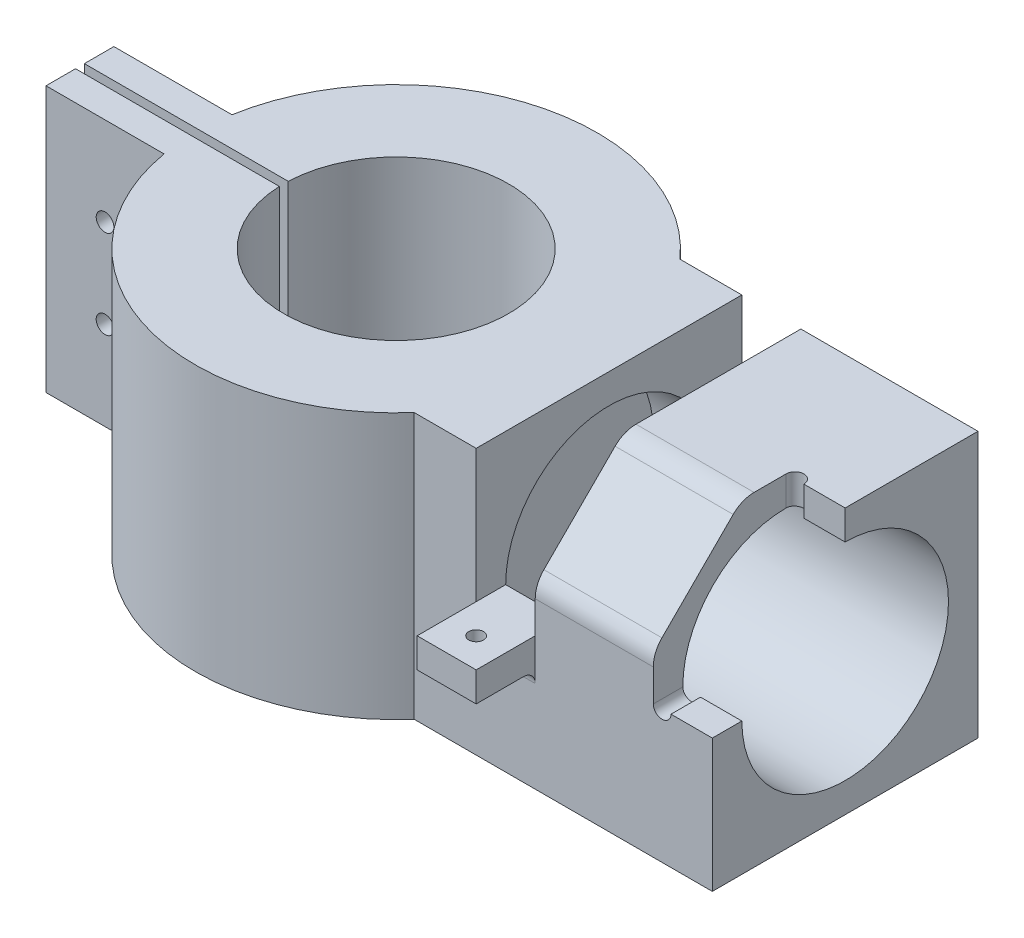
ISO-10303-21;
HEADER;
FILE_DESCRIPTION(('STEP AP214'),'2;1');
FILE_NAME('part.step','',(''),(''),'','','');
FILE_SCHEMA(('AUTOMOTIVE_DESIGN { 1 0 10303 214 1 1 1 1 }'));
ENDSEC;
DATA;
#1=APPLICATION_CONTEXT('core data for automotive mechanical design processes');
#2=APPLICATION_PROTOCOL_DEFINITION('international standard','automotive_design',2000,#1);
#3=PRODUCT_CONTEXT('',#1,'mechanical');
#4=PRODUCT('Part','Part','',(#3));
#5=PRODUCT_RELATED_PRODUCT_CATEGORY('part','',(#4));
#6=PRODUCT_DEFINITION_FORMATION('','',#4);
#7=PRODUCT_DEFINITION_CONTEXT('part definition',#1,'design');
#8=PRODUCT_DEFINITION('design','',#6,#7);
#9=PRODUCT_DEFINITION_SHAPE('','',#8);
#10=(LENGTH_UNIT() NAMED_UNIT(*) SI_UNIT(.MILLI.,.METRE.));
#11=(NAMED_UNIT(*) PLANE_ANGLE_UNIT() SI_UNIT($,.RADIAN.));
#12=(NAMED_UNIT(*) SI_UNIT($,.STERADIAN.) SOLID_ANGLE_UNIT());
#13=UNCERTAINTY_MEASURE_WITH_UNIT(LENGTH_MEASURE(1.E-05),#10,'distance_accuracy_value','');
#14=(GEOMETRIC_REPRESENTATION_CONTEXT(3) GLOBAL_UNCERTAINTY_ASSIGNED_CONTEXT((#13)) GLOBAL_UNIT_ASSIGNED_CONTEXT((#10,
#11,#12)) REPRESENTATION_CONTEXT('',''));
#15=CARTESIAN_POINT('',(0.,0.,0.));
#16=DIRECTION('',(0.,0.,1.));
#17=DIRECTION('',(1.,0.,0.));
#18=AXIS2_PLACEMENT_3D('',#15,#16,#17);
#19=CARTESIAN_POINT('',(26.05,0.,0.));
#20=DIRECTION('',(1.,0.,0.));
#21=DIRECTION('',(0.,0.,-1.));
#22=AXIS2_PLACEMENT_3D('',#19,#20,#21);
#23=CYLINDRICAL_SURFACE('',#22,17.5);
#24=CARTESIAN_POINT('',(26.05,0.,0.));
#25=DIRECTION('',(1.,0.,0.));
#26=DIRECTION('',(0.,0.,-1.));
#27=AXIS2_PLACEMENT_3D('',#24,#25,#26);
#28=CIRCLE('',#27,17.5);
#29=CARTESIAN_POINT('',(26.05,0.,-17.5));
#30=VERTEX_POINT('',#29);
#31=EDGE_CURVE('E444',#30,#30,#28,.T.);
#32=ORIENTED_EDGE('',*,*,#31,.F.);
#33=EDGE_LOOP('',(#32));
#34=FACE_BOUND('',#33,.T.);
#35=DIRECTION('',(1.,0.,0.));
#36=VECTOR('',#35,1.);
#37=CARTESIAN_POINT('',(26.05,0.,17.5));
#38=LINE('',#37,#36);
#39=CARTESIAN_POINT('',(46.05,0.,17.5));
#40=VERTEX_POINT('',#39);
#41=CARTESIAN_POINT('',(36.05,0.,17.5));
#42=VERTEX_POINT('',#41);
#43=EDGE_CURVE('E570',#40,#42,#38,.F.);
#44=ORIENTED_EDGE('',*,*,#43,.F.);
#45=CARTESIAN_POINT('',(46.05,0.,0.));
#46=DIRECTION('',(-1.,0.,0.));
#47=DIRECTION('',(0.,0.,1.));
#48=AXIS2_PLACEMENT_3D('',#45,#46,#47);
#49=CIRCLE('',#48,17.5);
#50=CARTESIAN_POINT('',(46.05,0.,-17.5));
#51=VERTEX_POINT('',#50);
#52=EDGE_CURVE('E565',#51,#40,#49,.F.);
#53=ORIENTED_EDGE('',*,*,#52,.F.);
#54=DIRECTION('',(1.,0.,0.));
#55=VECTOR('',#54,1.);
#56=CARTESIAN_POINT('',(26.05,0.,-17.5));
#57=LINE('',#56,#55);
#58=CARTESIAN_POINT('',(36.05,0.,-17.5));
#59=VERTEX_POINT('',#58);
#60=EDGE_CURVE('E559',#59,#51,#57,.T.);
#61=ORIENTED_EDGE('',*,*,#60,.F.);
#62=CARTESIAN_POINT('',(36.05,0.,0.));
#63=DIRECTION('',(1.,0.,0.));
#64=DIRECTION('',(0.,0.,-1.));
#65=AXIS2_PLACEMENT_3D('',#62,#63,#64);
#66=CIRCLE('',#65,17.5);
#67=EDGE_CURVE('E567',#42,#59,#66,.F.);
#68=ORIENTED_EDGE('',*,*,#67,.F.);
#69=EDGE_LOOP('',(#44,#53,#61,#68));
#70=FACE_BOUND('',#69,.T.);
#71=CARTESIAN_POINT('',(67.55,17.4355957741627,-1.5));
#72=CARTESIAN_POINT('',(67.4659105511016,17.435596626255,-1.49999633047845));
#73=CARTESIAN_POINT('',(67.3817640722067,17.4362106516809,-1.49290517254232));
#74=CARTESIAN_POINT('',(67.215799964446,17.4386003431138,-1.46472193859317));
#75=CARTESIAN_POINT('',(67.1339850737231,17.4403773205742,-1.44361405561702));
#76=CARTESIAN_POINT('',(66.9751118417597,17.4448901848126,-1.38801287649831));
#77=CARTESIAN_POINT('',(66.8980508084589,17.4476255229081,-1.35352723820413));
#78=CARTESIAN_POINT('',(66.7508291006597,17.4537462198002,-1.27216323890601));
#79=CARTESIAN_POINT('',(66.6806669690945,17.4571314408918,-1.22528750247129));
#80=CARTESIAN_POINT('',(66.5490265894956,17.4641807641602,-1.12033690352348));
#81=CARTESIAN_POINT('',(66.4875696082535,17.4678455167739,-1.06223540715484));
#82=CARTESIAN_POINT('',(66.3752668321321,17.4750350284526,-0.936539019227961));
#83=CARTESIAN_POINT('',(66.3244215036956,17.4785597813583,-0.868943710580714));
#84=CARTESIAN_POINT('',(66.2347141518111,17.4850783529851,-0.726051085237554));
#85=CARTESIAN_POINT('',(66.1958705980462,17.4880713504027,-0.650742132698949));
#86=CARTESIAN_POINT('',(66.1313875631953,17.493182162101,-0.494641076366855));
#87=CARTESIAN_POINT('',(66.1057478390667,17.4952999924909,-0.413849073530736));
#88=CARTESIAN_POINT('',(66.0684616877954,17.4984172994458,-0.249287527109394));
#89=CARTESIAN_POINT('',(66.0567807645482,17.4994195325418,-0.165525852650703));
#90=CARTESIAN_POINT('',(66.0476371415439,17.5002020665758,0.00277475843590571));
#91=CARTESIAN_POINT('',(66.0501741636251,17.4999823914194,0.0873136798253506));
#92=CARTESIAN_POINT('',(66.0693662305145,17.4983481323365,0.25453509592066));
#93=CARTESIAN_POINT('',(66.0859841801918,17.4969366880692,0.33722188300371));
#94=CARTESIAN_POINT('',(66.1328086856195,17.4930812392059,0.498628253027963));
#95=CARTESIAN_POINT('',(66.1630153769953,17.4906372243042,0.577347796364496));
#96=CARTESIAN_POINT('',(66.2362011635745,17.4849861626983,0.728703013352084));
#97=CARTESIAN_POINT('',(66.2791968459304,17.4817781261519,0.801330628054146));
#98=CARTESIAN_POINT('',(66.3767280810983,17.4749594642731,0.938352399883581));
#99=CARTESIAN_POINT('',(66.4312638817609,17.4713488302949,1.0027463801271));
#100=CARTESIAN_POINT('',(66.550536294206,17.4641169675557,1.12168991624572));
#101=CARTESIAN_POINT('',(66.6153051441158,17.4604957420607,1.17620715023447));
#102=CARTESIAN_POINT('',(66.7530928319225,17.4536624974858,1.27359986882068));
#103=CARTESIAN_POINT('',(66.8261116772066,17.4504504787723,1.31647534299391));
#104=CARTESIAN_POINT('',(66.9783495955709,17.4447987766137,1.38936637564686));
#105=CARTESIAN_POINT('',(67.057569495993,17.4423591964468,1.41938021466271));
#106=CARTESIAN_POINT('',(67.2199497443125,17.4385306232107,1.46567184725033));
#107=CARTESIAN_POINT('',(67.3031100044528,17.4371416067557,1.48194994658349));
#108=CARTESIAN_POINT('',(67.4707274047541,17.4355752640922,1.50026701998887));
#109=CARTESIAN_POINT('',(67.5551795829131,17.4353941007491,1.50235108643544));
#110=CARTESIAN_POINT('',(67.7232320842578,17.4362538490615,1.49233909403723));
#111=CARTESIAN_POINT('',(67.8068324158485,17.4372947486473,1.48024317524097));
#112=CARTESIAN_POINT('',(67.9706784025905,17.4404778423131,1.44225218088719));
#113=CARTESIAN_POINT('',(68.0509289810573,17.4426183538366,1.4163781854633));
#114=CARTESIAN_POINT('',(68.2059500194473,17.4477580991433,1.35158694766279));
#115=CARTESIAN_POINT('',(68.280720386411,17.4507573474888,1.31266948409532));
#116=CARTESIAN_POINT('',(68.4228647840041,17.4572859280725,1.22278208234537));
#117=CARTESIAN_POINT('',(68.4902197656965,17.4608165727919,1.17178211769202));
#118=CARTESIAN_POINT('',(68.6154288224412,17.4680057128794,1.05922073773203));
#119=CARTESIAN_POINT('',(68.6732827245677,17.4716642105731,0.997659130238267));
#120=CARTESIAN_POINT('',(68.7780014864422,17.4787082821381,0.865527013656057));
#121=CARTESIAN_POINT('',(68.8248370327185,17.4820931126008,0.794933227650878));
#122=CARTESIAN_POINT('',(68.9059883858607,17.4881977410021,0.646856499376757));
#123=CARTESIAN_POINT('',(68.9403043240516,17.4909175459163,0.569373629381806));
#124=CARTESIAN_POINT('',(68.9953921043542,17.4953822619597,0.4098228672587));
#125=CARTESIAN_POINT('',(69.0161820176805,17.4971284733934,0.327761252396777));
#126=CARTESIAN_POINT('',(69.0436866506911,17.499454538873,0.161296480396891));
#127=CARTESIAN_POINT('',(69.0504016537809,17.5000344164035,0.0768933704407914));
#128=CARTESIAN_POINT('',(69.0495624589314,17.4999625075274,-0.0915696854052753));
#129=CARTESIAN_POINT('',(69.0420539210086,17.4993146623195,-0.17562986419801));
#130=CARTESIAN_POINT('',(69.0130760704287,17.4968678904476,-0.341290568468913));
#131=CARTESIAN_POINT('',(68.9916067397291,17.4950689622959,-0.422891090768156));
#132=CARTESIAN_POINT('',(68.9353284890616,17.4905218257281,-0.581318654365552));
#133=CARTESIAN_POINT('',(68.900520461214,17.4877736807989,-0.658146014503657));
#134=CARTESIAN_POINT('',(68.8185580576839,17.4816354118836,-0.804874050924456));
#135=CARTESIAN_POINT('',(68.7714038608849,17.4782452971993,-0.874774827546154));
#136=CARTESIAN_POINT('',(68.6659162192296,17.4711905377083,-1.00589923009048));
#137=CARTESIAN_POINT('',(68.6075489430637,17.4675250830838,-1.06709559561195));
#138=CARTESIAN_POINT('',(68.48135410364,17.4603396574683,-1.17884845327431));
#139=CARTESIAN_POINT('',(68.4135242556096,17.4568197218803,-1.22940236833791));
#140=CARTESIAN_POINT('',(68.2701906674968,17.4503164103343,-1.3185079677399));
#141=CARTESIAN_POINT('',(68.1946721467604,17.4473340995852,-1.35703593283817));
#142=CARTESIAN_POINT('',(68.0382633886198,17.4422566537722,-1.42081523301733));
#143=CARTESIAN_POINT('',(67.9573794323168,17.4401605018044,-1.44608179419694));
#144=CARTESIAN_POINT('',(67.8216839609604,17.4376304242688,-1.47620361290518));
#145=CARTESIAN_POINT('',(67.7677445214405,17.4368709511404,-1.48511535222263));
#146=CARTESIAN_POINT('',(67.6592114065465,17.4358533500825,-1.49701472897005));
#147=CARTESIAN_POINT('',(67.604617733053,17.4355952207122,-1.50000238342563));
#148=CARTESIAN_POINT('',(67.55,17.4355957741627,-1.5));
#149=B_SPLINE_CURVE_WITH_KNOTS('',3,(#71,#72,#73,#74,#75,#76,#77,#78,#79,#80,#81,#82,#83,#84,
#85,#86,#87,#88,#89,#90,#91,#92,#93,#94,#95,#96,#97,#98,#99,#100,#101,#102,#103,#104,#105,#106,
#107,#108,#109,#110,#111,#112,#113,#114,#115,#116,#117,#118,#119,#120,#121,#122,#123,#124,#125,
#126,#127,#128,#129,#130,#131,#132,#133,#134,#135,#136,#137,#138,#139,#140,#141,#142,#143,#144,
#145,#146,#147,#148),.UNSPECIFIED.,.T.,.F.,(4,2,2,2,2,2,2,2,2,2,2,2,2,2,2,2,2,2,2,2,2,2,2,2,2,2,
2,2,2,2,2,2,2,2,2,2,2,2,4),(0.,0.252068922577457,0.504422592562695,0.756632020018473,
1.00878806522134,1.26154988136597,1.51432280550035,1.76748280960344,2.0206381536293,
2.27316657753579,2.52569006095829,2.77755035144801,3.02941315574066,3.28160405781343,
3.53380037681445,3.78680766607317,4.03981518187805,4.29285651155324,4.54589220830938,
4.79812367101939,5.05035264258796,5.30219681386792,5.55404525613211,5.80652626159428,
6.05901186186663,6.31216177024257,6.56530902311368,6.81811736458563,7.0709206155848,
7.32291369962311,7.5749071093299,7.82688366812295,8.07885657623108,8.33160201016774,
8.58440857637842,8.83771065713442,9.09072126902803,9.25444540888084,9.41816907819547),.UNSPECIFIED.);
#150=CARTESIAN_POINT('',(69.05,17.5,0.));
#151=VERTEX_POINT('',#150);
#152=CARTESIAN_POINT('',(66.05,17.5,0.));
#153=VERTEX_POINT('',#152);
#154=EDGE_CURVE('E367',#151,#153,#149,.T.);
#155=ORIENTED_EDGE('',*,*,#154,.T.);
#156=CARTESIAN_POINT('',(66.05,0.,0.));
#157=DIRECTION('',(1.,0.,0.));
#158=DIRECTION('',(0.,0.,-1.));
#159=AXIS2_PLACEMENT_3D('',#156,#157,#158);
#160=CIRCLE('',#159,17.5);
#161=CARTESIAN_POINT('',(66.05,0.,17.5));
#162=VERTEX_POINT('',#161);
#163=EDGE_CURVE('E575',#162,#153,#160,.F.);
#164=ORIENTED_EDGE('',*,*,#163,.F.);
#165=CARTESIAN_POINT('',(67.55,1.49999999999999,17.4355957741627));
#166=CARTESIAN_POINT('',(67.4659105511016,1.49999633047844,17.435596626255));
#167=CARTESIAN_POINT('',(67.3817640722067,1.49290517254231,17.4362106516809));
#168=CARTESIAN_POINT('',(67.215799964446,1.46472193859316,17.4386003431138));
#169=CARTESIAN_POINT('',(67.1339850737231,1.44361405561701,17.4403773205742));
#170=CARTESIAN_POINT('',(66.9751118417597,1.3880128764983,17.4448901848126));
#171=CARTESIAN_POINT('',(66.8980508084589,1.35352723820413,17.4476255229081));
#172=CARTESIAN_POINT('',(66.7508291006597,1.272163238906,17.4537462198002));
#173=CARTESIAN_POINT('',(66.6806669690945,1.22528750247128,17.4571314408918));
#174=CARTESIAN_POINT('',(66.5490265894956,1.12033690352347,17.4641807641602));
#175=CARTESIAN_POINT('',(66.4875696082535,1.06223540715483,17.4678455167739));
#176=CARTESIAN_POINT('',(66.3752668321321,0.936539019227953,17.4750350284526));
#177=CARTESIAN_POINT('',(66.3244215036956,0.868943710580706,17.4785597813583));
#178=CARTESIAN_POINT('',(66.2347141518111,0.726051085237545,17.4850783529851));
#179=CARTESIAN_POINT('',(66.1958705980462,0.650742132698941,17.4880713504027));
#180=CARTESIAN_POINT('',(66.1313875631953,0.494641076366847,17.493182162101));
#181=CARTESIAN_POINT('',(66.1057478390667,0.413849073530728,17.4952999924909));
#182=CARTESIAN_POINT('',(66.0684616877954,0.249287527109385,17.4984172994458));
#183=CARTESIAN_POINT('',(66.0567807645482,0.165525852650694,17.4994195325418));
#184=CARTESIAN_POINT('',(66.0476371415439,-0.00277475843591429,17.5002020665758));
#185=CARTESIAN_POINT('',(66.0501741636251,-0.0873136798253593,17.4999823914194));
#186=CARTESIAN_POINT('',(66.0693662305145,-0.254535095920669,17.4983481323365));
#187=CARTESIAN_POINT('',(66.0859841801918,-0.337221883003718,17.4969366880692));
#188=CARTESIAN_POINT('',(66.1328086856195,-0.498628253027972,17.4930812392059));
#189=CARTESIAN_POINT('',(66.1630153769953,-0.577347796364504,17.4906372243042));
#190=CARTESIAN_POINT('',(66.2362011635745,-0.728703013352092,17.4849861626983));
#191=CARTESIAN_POINT('',(66.2791968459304,-0.801330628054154,17.4817781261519));
#192=CARTESIAN_POINT('',(66.3767280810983,-0.938352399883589,17.4749594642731));
#193=CARTESIAN_POINT('',(66.4312638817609,-1.00274638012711,17.4713488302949));
#194=CARTESIAN_POINT('',(66.550536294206,-1.12168991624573,17.4641169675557));
#195=CARTESIAN_POINT('',(66.6153051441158,-1.17620715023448,17.4604957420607));
#196=CARTESIAN_POINT('',(66.7530928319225,-1.27359986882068,17.4536624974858));
#197=CARTESIAN_POINT('',(66.8261116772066,-1.31647534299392,17.4504504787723));
#198=CARTESIAN_POINT('',(66.9783495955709,-1.38936637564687,17.4447987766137));
#199=CARTESIAN_POINT('',(67.057569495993,-1.41938021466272,17.4423591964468));
#200=CARTESIAN_POINT('',(67.2199497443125,-1.46567184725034,17.4385306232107));
#201=CARTESIAN_POINT('',(67.3031100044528,-1.4819499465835,17.4371416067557));
#202=CARTESIAN_POINT('',(67.4707274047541,-1.50026701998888,17.4355752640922));
#203=CARTESIAN_POINT('',(67.5551795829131,-1.50235108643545,17.4353941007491));
#204=CARTESIAN_POINT('',(67.7232320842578,-1.49233909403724,17.4362538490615));
#205=CARTESIAN_POINT('',(67.8068324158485,-1.48024317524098,17.4372947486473));
#206=CARTESIAN_POINT('',(67.9706784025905,-1.4422521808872,17.4404778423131));
#207=CARTESIAN_POINT('',(68.0509289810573,-1.41637818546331,17.4426183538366));
#208=CARTESIAN_POINT('',(68.2059500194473,-1.3515869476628,17.4477580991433));
#209=CARTESIAN_POINT('',(68.280720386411,-1.31266948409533,17.4507573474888));
#210=CARTESIAN_POINT('',(68.4228647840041,-1.22278208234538,17.4572859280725));
#211=CARTESIAN_POINT('',(68.4902197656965,-1.17178211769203,17.4608165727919));
#212=CARTESIAN_POINT('',(68.6154288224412,-1.05922073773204,17.4680057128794));
#213=CARTESIAN_POINT('',(68.6732827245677,-0.997659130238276,17.4716642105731));
#214=CARTESIAN_POINT('',(68.7780014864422,-0.865527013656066,17.4787082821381));
#215=CARTESIAN_POINT('',(68.8248370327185,-0.794933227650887,17.4820931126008));
#216=CARTESIAN_POINT('',(68.9059883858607,-0.646856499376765,17.4881977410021));
#217=CARTESIAN_POINT('',(68.9403043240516,-0.569373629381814,17.4909175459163));
#218=CARTESIAN_POINT('',(68.9953921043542,-0.409822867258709,17.4953822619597));
#219=CARTESIAN_POINT('',(69.0161820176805,-0.327761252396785,17.4971284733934));
#220=CARTESIAN_POINT('',(69.0436866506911,-0.161296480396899,17.499454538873));
#221=CARTESIAN_POINT('',(69.0504016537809,-0.0768933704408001,17.5000344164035));
#222=CARTESIAN_POINT('',(69.0495624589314,0.091569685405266,17.4999625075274));
#223=CARTESIAN_POINT('',(69.0420539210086,0.175629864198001,17.4993146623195));
#224=CARTESIAN_POINT('',(69.0130760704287,0.341290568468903,17.4968678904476));
#225=CARTESIAN_POINT('',(68.9916067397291,0.422891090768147,17.4950689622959));
#226=CARTESIAN_POINT('',(68.9353284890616,0.581318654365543,17.4905218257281));
#227=CARTESIAN_POINT('',(68.900520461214,0.658146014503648,17.4877736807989));
#228=CARTESIAN_POINT('',(68.8185580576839,0.804874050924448,17.4816354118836));
#229=CARTESIAN_POINT('',(68.7714038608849,0.874774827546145,17.4782452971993));
#230=CARTESIAN_POINT('',(68.6659162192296,1.00589923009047,17.4711905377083));
#231=CARTESIAN_POINT('',(68.6075489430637,1.06709559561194,17.4675250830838));
#232=CARTESIAN_POINT('',(68.48135410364,1.1788484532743,17.4603396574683));
#233=CARTESIAN_POINT('',(68.4135242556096,1.2294023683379,17.4568197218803));
#234=CARTESIAN_POINT('',(68.2701906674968,1.3185079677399,17.4503164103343));
#235=CARTESIAN_POINT('',(68.1946721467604,1.35703593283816,17.4473340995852));
#236=CARTESIAN_POINT('',(68.0382633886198,1.42081523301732,17.4422566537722));
#237=CARTESIAN_POINT('',(67.9573794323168,1.44608179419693,17.4401605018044));
#238=CARTESIAN_POINT('',(67.8216839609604,1.47620361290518,17.4376304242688));
#239=CARTESIAN_POINT('',(67.7677445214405,1.48511535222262,17.4368709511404));
#240=CARTESIAN_POINT('',(67.6592114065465,1.49701472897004,17.4358533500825));
#241=CARTESIAN_POINT('',(67.604617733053,1.50000238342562,17.4355952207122));
#242=CARTESIAN_POINT('',(67.55,1.49999999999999,17.4355957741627));
#243=B_SPLINE_CURVE_WITH_KNOTS('',3,(#165,#166,#167,#168,#169,#170,#171,#172,#173,#174,#175,
#176,#177,#178,#179,#180,#181,#182,#183,#184,#185,#186,#187,#188,#189,#190,#191,#192,#193,#194,
#195,#196,#197,#198,#199,#200,#201,#202,#203,#204,#205,#206,#207,#208,#209,#210,#211,#212,#213,
#214,#215,#216,#217,#218,#219,#220,#221,#222,#223,#224,#225,#226,#227,#228,#229,#230,#231,#232,
#233,#234,#235,#236,#237,#238,#239,#240,#241,#242),.UNSPECIFIED.,.T.,.F.,(4,2,2,2,2,2,2,2,2,2,2,
2,2,2,2,2,2,2,2,2,2,2,2,2,2,2,2,2,2,2,2,2,2,2,2,2,2,2,4),(0.,0.252068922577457,
0.504422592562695,0.756632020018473,1.00878806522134,1.26154988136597,1.51432280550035,
1.76748280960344,2.0206381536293,2.27316657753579,2.52569006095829,2.77755035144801,
3.02941315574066,3.28160405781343,3.53380037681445,3.78680766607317,4.03981518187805,
4.29285651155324,4.54589220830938,4.79812367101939,5.05035264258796,5.30219681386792,
5.55404525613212,5.80652626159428,6.05901186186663,6.31216177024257,6.56530902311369,
6.81811736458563,7.0709206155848,7.32291369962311,7.5749071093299,7.82688366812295,
8.07885657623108,8.33160201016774,8.58440857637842,8.83771065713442,9.09072126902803,
9.25444540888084,9.41816907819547),.UNSPECIFIED.);
#244=CARTESIAN_POINT('',(69.05,0.,17.5));
#245=VERTEX_POINT('',#244);
#246=EDGE_CURVE('E390',#162,#245,#243,.T.);
#247=ORIENTED_EDGE('',*,*,#246,.T.);
#248=DIRECTION('',(1.,0.,0.));
#249=VECTOR('',#248,1.);
#250=CARTESIAN_POINT('',(26.05,0.,17.5));
#251=LINE('',#250,#249);
#252=CARTESIAN_POINT('',(76.05,0.,17.5));
#253=VERTEX_POINT('',#252);
#254=EDGE_CURVE('E415',#245,#253,#251,.T.);
#255=ORIENTED_EDGE('',*,*,#254,.T.);
#256=CARTESIAN_POINT('',(76.05,0.,0.));
#257=DIRECTION('',(1.,0.,0.));
#258=DIRECTION('',(0.,0.,-1.));
#259=AXIS2_PLACEMENT_3D('',#256,#257,#258);
#260=CIRCLE('',#259,17.5);
#261=CARTESIAN_POINT('',(76.05,17.5,0.));
#262=VERTEX_POINT('',#261);
#263=EDGE_CURVE('E443',#253,#262,#260,.T.);
#264=ORIENTED_EDGE('',*,*,#263,.T.);
#265=DIRECTION('',(1.,0.,0.));
#266=VECTOR('',#265,1.);
#267=CARTESIAN_POINT('',(26.05,17.5,0.));
#268=LINE('',#267,#266);
#269=EDGE_CURVE('E418',#262,#151,#268,.F.);
#270=ORIENTED_EDGE('',*,*,#269,.T.);
#271=EDGE_LOOP('',(#155,#164,#247,#255,#264,#270));
#272=FACE_BOUND('',#271,.T.);
#273=ADVANCED_FACE('F78',(#34,#70,#272),#23,.F.);
#274=CARTESIAN_POINT('',(66.05,0.,0.));
#275=DIRECTION('',(0.,0.,-1.));
#276=DIRECTION('',(-1.,0.,0.));
#277=AXIS2_PLACEMENT_3D('',#274,#275,#276);
#278=PLANE('',#277);
#279=DIRECTION('',(0.,-1.,0.));
#280=VECTOR('',#279,1.);
#281=CARTESIAN_POINT('',(69.05,22.5,0.));
#282=LINE('',#281,#280);
#283=CARTESIAN_POINT('',(69.05,22.5,0.));
#284=VERTEX_POINT('',#283);
#285=EDGE_CURVE('E580',#151,#284,#282,.F.);
#286=ORIENTED_EDGE('',*,*,#285,.F.);
#287=ORIENTED_EDGE('',*,*,#269,.F.);
#288=DIRECTION('',(0.,1.,0.));
#289=VECTOR('',#288,1.);
#290=CARTESIAN_POINT('',(76.05,0.,0.));
#291=LINE('',#290,#289);
#292=CARTESIAN_POINT('',(76.05,22.5,0.));
#293=VERTEX_POINT('',#292);
#294=EDGE_CURVE('E572',#262,#293,#291,.T.);
#295=ORIENTED_EDGE('',*,*,#294,.T.);
#296=DIRECTION('',(1.,0.,0.));
#297=VECTOR('',#296,1.);
#298=CARTESIAN_POINT('',(66.05,22.5,0.));
#299=LINE('',#298,#297);
#300=EDGE_CURVE('E410',#284,#293,#299,.T.);
#301=ORIENTED_EDGE('',*,*,#300,.F.);
#302=EDGE_LOOP('',(#286,#287,#295,#301));
#303=FACE_BOUND('',#302,.T.);
#304=ADVANCED_FACE('F747',(#303),#278,.F.);
#305=CARTESIAN_POINT('',(66.05,0.,0.));
#306=DIRECTION('',(0.,-1.,0.));
#307=DIRECTION('',(0.,0.,-1.));
#308=AXIS2_PLACEMENT_3D('',#305,#306,#307);
#309=PLANE('',#308);
#310=DIRECTION('',(0.,0.,-1.));
#311=VECTOR('',#310,1.);
#312=CARTESIAN_POINT('',(69.05,0.,22.5));
#313=LINE('',#312,#311);
#314=CARTESIAN_POINT('',(69.05,0.,22.5));
#315=VERTEX_POINT('',#314);
#316=EDGE_CURVE('E578',#315,#245,#313,.T.);
#317=ORIENTED_EDGE('',*,*,#316,.F.);
#318=DIRECTION('',(1.,0.,0.));
#319=VECTOR('',#318,1.);
#320=CARTESIAN_POINT('',(66.05,0.,22.5));
#321=LINE('',#320,#319);
#322=CARTESIAN_POINT('',(76.05,0.,22.5));
#323=VERTEX_POINT('',#322);
#324=EDGE_CURVE('E413',#315,#323,#321,.T.);
#325=ORIENTED_EDGE('',*,*,#324,.T.);
#326=DIRECTION('',(0.,0.,-1.));
#327=VECTOR('',#326,1.);
#328=CARTESIAN_POINT('',(76.05,0.,0.));
#329=LINE('',#328,#327);
#330=EDGE_CURVE('E398',#323,#253,#329,.T.);
#331=ORIENTED_EDGE('',*,*,#330,.T.);
#332=ORIENTED_EDGE('',*,*,#254,.F.);
#333=EDGE_LOOP('',(#317,#325,#331,#332));
#334=FACE_BOUND('',#333,.T.);
#335=ADVANCED_FACE('F724',(#334),#309,.F.);
#336=CARTESIAN_POINT('',(0.,22.5,0.));
#337=DIRECTION('',(0.,1.,0.));
#338=DIRECTION('',(0.,0.,1.));
#339=AXIS2_PLACEMENT_3D('',#336,#337,#338);
#340=PLANE('',#339);
#341=DIRECTION('',(1.,0.,0.));
#342=VECTOR('',#341,1.);
#343=CARTESIAN_POINT('',(-53.5619892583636,22.5,22.5));
#344=LINE('',#343,#342);
#345=CARTESIAN_POINT('',(25.5568483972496,22.5,22.5));
#346=VERTEX_POINT('',#345);
#347=CARTESIAN_POINT('',(36.05,22.5,22.5));
#348=VERTEX_POINT('',#347);
#349=EDGE_CURVE('E465',#346,#348,#344,.T.);
#350=ORIENTED_EDGE('',*,*,#349,.T.);
#351=DIRECTION('',(0.,0.,1.));
#352=VECTOR('',#351,1.);
#353=CARTESIAN_POINT('',(36.05,22.5,-22.5));
#354=LINE('',#353,#352);
#355=CARTESIAN_POINT('',(36.05,22.5,-22.5));
#356=VERTEX_POINT('',#355);
#357=EDGE_CURVE('E422',#356,#348,#354,.T.);
#358=ORIENTED_EDGE('',*,*,#357,.F.);
#359=DIRECTION('',(1.,0.,0.));
#360=VECTOR('',#359,1.);
#361=CARTESIAN_POINT('',(-53.5619892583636,22.5,-22.5));
#362=LINE('',#361,#360);
#363=CARTESIAN_POINT('',(25.5568483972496,22.5,-22.5));
#364=VERTEX_POINT('',#363);
#365=EDGE_CURVE('E475',#364,#356,#362,.T.);
#366=ORIENTED_EDGE('',*,*,#365,.F.);
#367=CARTESIAN_POINT('',(0.,22.5,0.));
#368=DIRECTION('',(0.,1.,0.));
#369=DIRECTION('',(0.,0.,-1.));
#370=AXIS2_PLACEMENT_3D('',#367,#368,#369);
#371=CIRCLE('',#370,34.05);
#372=CARTESIAN_POINT('',(-33.5609892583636,22.5,-5.75));
#373=VERTEX_POINT('',#372);
#374=EDGE_CURVE('E511',#364,#373,#371,.T.);
#375=ORIENTED_EDGE('',*,*,#374,.T.);
#376=DIRECTION('',(-1.,0.,0.));
#377=VECTOR('',#376,1.);
#378=CARTESIAN_POINT('',(-53.5609892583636,22.5,-5.75));
#379=LINE('',#378,#377);
#380=CARTESIAN_POINT('',(-53.5609892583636,22.5,-5.75));
#381=VERTEX_POINT('',#380);
#382=EDGE_CURVE('E515',#373,#381,#379,.T.);
#383=ORIENTED_EDGE('',*,*,#382,.T.);
#384=DIRECTION('',(0.,0.,1.));
#385=VECTOR('',#384,1.);
#386=CARTESIAN_POINT('',(-53.5609892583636,22.5,-0.75));
#387=LINE('',#386,#385);
#388=CARTESIAN_POINT('',(-53.5609892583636,22.5,-0.75));
#389=VERTEX_POINT('',#388);
#390=EDGE_CURVE('E517',#381,#389,#387,.T.);
#391=ORIENTED_EDGE('',*,*,#390,.T.);
#392=DIRECTION('',(1.,0.,0.));
#393=VECTOR('',#392,1.);
#394=CARTESIAN_POINT('',(-53.5609892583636,22.5,-0.75));
#395=LINE('',#394,#393);
#396=CARTESIAN_POINT('',(-19.0352304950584,22.5,-0.749999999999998));
#397=VERTEX_POINT('',#396);
#398=EDGE_CURVE('E499',#389,#397,#395,.T.);
#399=ORIENTED_EDGE('',*,*,#398,.T.);
#400=CARTESIAN_POINT('',(0.,22.5,0.));
#401=DIRECTION('',(0.,-1.,0.));
#402=DIRECTION('',(0.,0.,1.));
#403=AXIS2_PLACEMENT_3D('',#400,#401,#402);
#404=CIRCLE('',#403,19.05);
#405=CARTESIAN_POINT('',(-19.0352304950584,22.5,0.75));
#406=VERTEX_POINT('',#405);
#407=EDGE_CURVE('E502',#397,#406,#404,.T.);
#408=ORIENTED_EDGE('',*,*,#407,.T.);
#409=DIRECTION('',(-1.,0.,0.));
#410=VECTOR('',#409,1.);
#411=CARTESIAN_POINT('',(-53.5609892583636,22.5,0.75));
#412=LINE('',#411,#410);
#413=CARTESIAN_POINT('',(-53.5609892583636,22.5,0.75));
#414=VERTEX_POINT('',#413);
#415=EDGE_CURVE('E505',#406,#414,#412,.T.);
#416=ORIENTED_EDGE('',*,*,#415,.T.);
#417=DIRECTION('',(0.,0.,1.));
#418=VECTOR('',#417,1.);
#419=CARTESIAN_POINT('',(-53.5609892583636,22.5,5.75));
#420=LINE('',#419,#418);
#421=CARTESIAN_POINT('',(-53.5609892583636,22.5,5.75));
#422=VERTEX_POINT('',#421);
#423=EDGE_CURVE('E507',#414,#422,#420,.T.);
#424=ORIENTED_EDGE('',*,*,#423,.T.);
#425=DIRECTION('',(1.,0.,0.));
#426=VECTOR('',#425,1.);
#427=CARTESIAN_POINT('',(-33.5609892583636,22.5,5.75));
#428=LINE('',#427,#426);
#429=CARTESIAN_POINT('',(-33.5609892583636,22.5,5.75000000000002));
#430=VERTEX_POINT('',#429);
#431=EDGE_CURVE('E509',#422,#430,#428,.T.);
#432=ORIENTED_EDGE('',*,*,#431,.T.);
#433=EDGE_CURVE('E512',#430,#346,#371,.T.);
#434=ORIENTED_EDGE('',*,*,#433,.T.);
#435=EDGE_LOOP('',(#350,#358,#366,#375,#383,#391,#399,#408,#416,#424,#432,#434));
#436=FACE_BOUND('',#435,.T.);
#437=ADVANCED_FACE('F639',(#436),#340,.T.);
#438=DIRECTION('',(0.,0.,-1.));
#439=VECTOR('',#438,1.);
#440=CARTESIAN_POINT('',(46.05,22.5,-22.5));
#441=LINE('',#440,#439);
#442=CARTESIAN_POINT('',(46.05,22.5,5.42893218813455));
#443=VERTEX_POINT('',#442);
#444=CARTESIAN_POINT('',(46.05,22.5,-22.5));
#445=VERTEX_POINT('',#444);
#446=EDGE_CURVE('E424',#443,#445,#441,.T.);
#447=ORIENTED_EDGE('',*,*,#446,.F.);
#448=DIRECTION('',(-1.,0.,0.));
#449=VECTOR('',#448,1.);
#450=CARTESIAN_POINT('',(0.,22.5,5.42893218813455));
#451=LINE('',#450,#449);
#452=CARTESIAN_POINT('',(66.05,22.5,5.42893218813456));
#453=VERTEX_POINT('',#452);
#454=EDGE_CURVE('E593',#443,#453,#451,.F.);
#455=ORIENTED_EDGE('',*,*,#454,.T.);
#456=DIRECTION('',(0.,0.,1.));
#457=VECTOR('',#456,1.);
#458=CARTESIAN_POINT('',(66.05,22.5,0.));
#459=LINE('',#458,#457);
#460=CARTESIAN_POINT('',(66.05,22.5,0.));
#461=VERTEX_POINT('',#460);
#462=EDGE_CURVE('E402',#461,#453,#459,.T.);
#463=ORIENTED_EDGE('',*,*,#462,.F.);
#464=CARTESIAN_POINT('',(67.55,22.5,0.));
#465=DIRECTION('',(0.,1.,0.));
#466=DIRECTION('',(0.,0.,1.));
#467=AXIS2_PLACEMENT_3D('',#464,#465,#466);
#468=CIRCLE('',#467,1.5);
#469=EDGE_CURVE('E375',#284,#461,#468,.T.);
#470=ORIENTED_EDGE('',*,*,#469,.F.);
#471=ORIENTED_EDGE('',*,*,#300,.T.);
#472=DIRECTION('',(0.,0.,1.));
#473=VECTOR('',#472,1.);
#474=CARTESIAN_POINT('',(76.05,22.5,22.5));
#475=LINE('',#474,#473);
#476=CARTESIAN_POINT('',(76.05,22.5,-22.5));
#477=VERTEX_POINT('',#476);
#478=EDGE_CURVE('E457',#477,#293,#475,.T.);
#479=ORIENTED_EDGE('',*,*,#478,.F.);
#480=EDGE_CURVE('E469',#445,#477,#362,.T.);
#481=ORIENTED_EDGE('',*,*,#480,.F.);
#482=EDGE_LOOP('',(#447,#455,#463,#470,#471,#479,#481));
#483=FACE_BOUND('',#482,.T.);
#484=ADVANCED_FACE('F665',(#483),#340,.T.);
#485=CARTESIAN_POINT('',(-53.5619892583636,22.5,-22.5));
#486=DIRECTION('',(0.,0.,-1.));
#487=DIRECTION('',(0.,1.,0.));
#488=AXIS2_PLACEMENT_3D('',#485,#486,#487);
#489=PLANE('',#488);
#490=DIRECTION('',(1.,0.,0.));
#491=VECTOR('',#490,1.);
#492=CARTESIAN_POINT('',(-53.5619892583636,-7.,-22.5));
#493=LINE('',#492,#491);
#494=CARTESIAN_POINT('',(36.05,-7.,-22.5));
#495=VERTEX_POINT('',#494);
#496=CARTESIAN_POINT('',(46.05,-7.,-22.5));
#497=VERTEX_POINT('',#496);
#498=EDGE_CURVE('E611',#495,#497,#493,.T.);
#499=ORIENTED_EDGE('',*,*,#498,.T.);
#500=DIRECTION('',(0.,-1.,0.));
#501=VECTOR('',#500,1.);
#502=CARTESIAN_POINT('',(46.05,22.5,-22.5));
#503=LINE('',#502,#501);
#504=CARTESIAN_POINT('',(46.05,0.,-22.5));
#505=VERTEX_POINT('',#504);
#506=EDGE_CURVE('E340',#505,#497,#503,.T.);
#507=ORIENTED_EDGE('',*,*,#506,.F.);
#508=DIRECTION('',(0.,-1.,0.));
#509=VECTOR('',#508,1.);
#510=CARTESIAN_POINT('',(46.05,22.5,-22.5));
#511=LINE('',#510,#509);
#512=EDGE_CURVE('E435',#445,#505,#511,.T.);
#513=ORIENTED_EDGE('',*,*,#512,.F.);
#514=ORIENTED_EDGE('',*,*,#480,.T.);
#515=DIRECTION('',(0.,1.,0.));
#516=VECTOR('',#515,1.);
#517=CARTESIAN_POINT('',(76.05,22.5,-22.5));
#518=LINE('',#517,#516);
#519=CARTESIAN_POINT('',(76.05,-22.5,-22.5));
#520=VERTEX_POINT('',#519);
#521=EDGE_CURVE('E454',#520,#477,#518,.T.);
#522=ORIENTED_EDGE('',*,*,#521,.F.);
#523=DIRECTION('',(1.,0.,0.));
#524=VECTOR('',#523,1.);
#525=CARTESIAN_POINT('',(-53.5619892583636,-22.5,-22.5));
#526=LINE('',#525,#524);
#527=CARTESIAN_POINT('',(25.5568483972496,-22.5,-22.5));
#528=VERTEX_POINT('',#527);
#529=EDGE_CURVE('E460',#528,#520,#526,.T.);
#530=ORIENTED_EDGE('',*,*,#529,.F.);
#531=DIRECTION('',(0.,-1.,0.));
#532=VECTOR('',#531,1.);
#533=CARTESIAN_POINT('',(25.5568483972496,22.5,-22.5));
#534=LINE('',#533,#532);
#535=EDGE_CURVE('E466',#528,#364,#534,.F.);
#536=ORIENTED_EDGE('',*,*,#535,.T.);
#537=ORIENTED_EDGE('',*,*,#365,.T.);
#538=DIRECTION('',(0.,-1.,0.));
#539=VECTOR('',#538,1.);
#540=CARTESIAN_POINT('',(36.05,22.5,-22.5));
#541=LINE('',#540,#539);
#542=CARTESIAN_POINT('',(36.05,0.,-22.5));
#543=VERTEX_POINT('',#542);
#544=EDGE_CURVE('E427',#356,#543,#541,.T.);
#545=ORIENTED_EDGE('',*,*,#544,.T.);
#546=DIRECTION('',(0.,1.,0.));
#547=VECTOR('',#546,1.);
#548=CARTESIAN_POINT('',(36.05,22.5,-22.5));
#549=LINE('',#548,#547);
#550=EDGE_CURVE('E323',#495,#543,#549,.T.);
#551=ORIENTED_EDGE('',*,*,#550,.F.);
#552=EDGE_LOOP('',(#499,#507,#513,#514,#522,#530,#536,#537,#545,#551));
#553=FACE_BOUND('',#552,.T.);
#554=ADVANCED_FACE('F631',(#553),#489,.T.);
#555=CARTESIAN_POINT('',(-53.5619892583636,22.5,22.5));
#556=DIRECTION('',(0.,0.,1.));
#557=DIRECTION('',(0.,-1.,0.));
#558=AXIS2_PLACEMENT_3D('',#555,#556,#557);
#559=PLANE('',#558);
#560=DIRECTION('',(-1.,0.,0.));
#561=VECTOR('',#560,1.);
#562=CARTESIAN_POINT('',(-53.5619892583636,-7.,22.5));
#563=LINE('',#562,#561);
#564=CARTESIAN_POINT('',(46.05,-7.,22.5));
#565=VERTEX_POINT('',#564);
#566=CARTESIAN_POINT('',(36.05,-7.,22.5));
#567=VERTEX_POINT('',#566);
#568=EDGE_CURVE('E616',#565,#567,#563,.T.);
#569=ORIENTED_EDGE('',*,*,#568,.T.);
#570=DIRECTION('',(0.,-1.,0.));
#571=VECTOR('',#570,1.);
#572=CARTESIAN_POINT('',(36.05,22.5,22.5));
#573=LINE('',#572,#571);
#574=CARTESIAN_POINT('',(36.05,0.,22.5));
#575=VERTEX_POINT('',#574);
#576=EDGE_CURVE('E365',#575,#567,#573,.T.);
#577=ORIENTED_EDGE('',*,*,#576,.F.);
#578=DIRECTION('',(0.,-1.,0.));
#579=VECTOR('',#578,1.);
#580=CARTESIAN_POINT('',(36.05,22.5,22.5));
#581=LINE('',#580,#579);
#582=EDGE_CURVE('E440',#348,#575,#581,.T.);
#583=ORIENTED_EDGE('',*,*,#582,.F.);
#584=ORIENTED_EDGE('',*,*,#349,.F.);
#585=DIRECTION('',(0.,-1.,0.));
#586=VECTOR('',#585,1.);
#587=CARTESIAN_POINT('',(25.5568483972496,22.5,22.5));
#588=LINE('',#587,#586);
#589=CARTESIAN_POINT('',(25.5568483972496,-22.5,22.5));
#590=VERTEX_POINT('',#589);
#591=EDGE_CURVE('E461',#346,#590,#588,.T.);
#592=ORIENTED_EDGE('',*,*,#591,.T.);
#593=DIRECTION('',(1.,0.,0.));
#594=VECTOR('',#593,1.);
#595=CARTESIAN_POINT('',(-53.5619892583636,-22.5,22.5));
#596=LINE('',#595,#594);
#597=CARTESIAN_POINT('',(76.05,-22.5,22.5));
#598=VERTEX_POINT('',#597);
#599=EDGE_CURVE('E464',#590,#598,#596,.T.);
#600=ORIENTED_EDGE('',*,*,#599,.T.);
#601=DIRECTION('',(0.,-1.,0.));
#602=VECTOR('',#601,1.);
#603=CARTESIAN_POINT('',(76.05,22.5,22.5));
#604=LINE('',#603,#602);
#605=EDGE_CURVE('E447',#323,#598,#604,.T.);
#606=ORIENTED_EDGE('',*,*,#605,.F.);
#607=ORIENTED_EDGE('',*,*,#324,.F.);
#608=CARTESIAN_POINT('',(67.55,0.,22.5));
#609=DIRECTION('',(0.,0.,1.));
#610=DIRECTION('',(1.,0.,0.));
#611=AXIS2_PLACEMENT_3D('',#608,#609,#610);
#612=CIRCLE('',#611,1.5);
#613=CARTESIAN_POINT('',(66.05,0.,22.5));
#614=VERTEX_POINT('',#613);
#615=EDGE_CURVE('E396',#614,#315,#612,.T.);
#616=ORIENTED_EDGE('',*,*,#615,.F.);
#617=DIRECTION('',(0.,-1.,0.));
#618=VECTOR('',#617,1.);
#619=CARTESIAN_POINT('',(66.05,0.,22.5));
#620=LINE('',#619,#618);
#621=CARTESIAN_POINT('',(66.05,5.42893218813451,22.5));
#622=VERTEX_POINT('',#621);
#623=EDGE_CURVE('E405',#622,#614,#620,.T.);
#624=ORIENTED_EDGE('',*,*,#623,.F.);
#625=DIRECTION('',(1.,0.,0.));
#626=VECTOR('',#625,1.);
#627=CARTESIAN_POINT('',(-53.5619892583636,5.42893218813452,22.5));
#628=LINE('',#627,#626);
#629=CARTESIAN_POINT('',(46.05,5.42893218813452,22.5));
#630=VERTEX_POINT('',#629);
#631=EDGE_CURVE('E608',#622,#630,#628,.F.);
#632=ORIENTED_EDGE('',*,*,#631,.T.);
#633=DIRECTION('',(0.,-1.,0.));
#634=VECTOR('',#633,1.);
#635=CARTESIAN_POINT('',(46.05,22.5,22.5));
#636=LINE('',#635,#634);
#637=CARTESIAN_POINT('',(46.05,0.,22.5));
#638=VERTEX_POINT('',#637);
#639=EDGE_CURVE('E438',#630,#638,#636,.T.);
#640=ORIENTED_EDGE('',*,*,#639,.T.);
#641=DIRECTION('',(0.,1.,0.));
#642=VECTOR('',#641,1.);
#643=CARTESIAN_POINT('',(46.05,22.5,22.5));
#644=LINE('',#643,#642);
#645=EDGE_CURVE('E360',#565,#638,#644,.T.);
#646=ORIENTED_EDGE('',*,*,#645,.F.);
#647=EDGE_LOOP('',(#569,#577,#583,#584,#592,#600,#606,#607,#616,#624,#632,#640,#646));
#648=FACE_BOUND('',#647,.T.);
#649=ADVANCED_FACE('F643',(#648),#559,.T.);
#650=CARTESIAN_POINT('',(0.,22.5,0.));
#651=DIRECTION('',(0.,-1.,0.));
#652=DIRECTION('',(0.,0.,-1.));
#653=AXIS2_PLACEMENT_3D('',#650,#651,#652);
#654=CYLINDRICAL_SURFACE('',#653,34.05);
#655=ORIENTED_EDGE('',*,*,#374,.F.);
#656=ORIENTED_EDGE('',*,*,#535,.F.);
#657=CARTESIAN_POINT('',(0.,-22.5,0.));
#658=DIRECTION('',(0.,1.,0.));
#659=DIRECTION('',(0.,0.,-1.));
#660=AXIS2_PLACEMENT_3D('',#657,#658,#659);
#661=CIRCLE('',#660,34.05);
#662=CARTESIAN_POINT('',(-33.5609892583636,-22.5,-5.75));
#663=VERTEX_POINT('',#662);
#664=EDGE_CURVE('E530',#528,#663,#661,.T.);
#665=ORIENTED_EDGE('',*,*,#664,.T.);
#666=DIRECTION('',(0.,-1.,0.));
#667=VECTOR('',#666,1.);
#668=CARTESIAN_POINT('',(-33.5609892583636,22.5,-5.75));
#669=LINE('',#668,#667);
#670=EDGE_CURVE('E541',#373,#663,#669,.T.);
#671=ORIENTED_EDGE('',*,*,#670,.F.);
#672=EDGE_LOOP('',(#655,#656,#665,#671));
#673=FACE_BOUND('',#672,.T.);
#674=ADVANCED_FACE('F683',(#673),#654,.T.);
#675=CARTESIAN_POINT('',(-53.5609892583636,22.5,-0.75));
#676=DIRECTION('',(0.,0.,-1.));
#677=DIRECTION('',(-1.,0.,0.));
#678=AXIS2_PLACEMENT_3D('',#675,#676,#677);
#679=PLANE('',#678);
#680=CARTESIAN_POINT('',(-43.5609892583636,7.5,-0.75));
#681=DIRECTION('',(0.,0.,-1.));
#682=DIRECTION('',(-1.,0.,0.));
#683=AXIS2_PLACEMENT_3D('',#680,#681,#682);
#684=CIRCLE('',#683,1.49999999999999);
#685=CARTESIAN_POINT('',(-42.0609892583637,7.5,-0.749999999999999));
#686=VERTEX_POINT('',#685);
#687=EDGE_CURVE('E485',#686,#686,#684,.T.);
#688=ORIENTED_EDGE('',*,*,#687,.T.);
#689=EDGE_LOOP('',(#688));
#690=FACE_BOUND('',#689,.T.);
#691=CARTESIAN_POINT('',(-43.5609892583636,-7.5,-0.75));
#692=DIRECTION('',(0.,0.,-1.));
#693=DIRECTION('',(-1.,0.,0.));
#694=AXIS2_PLACEMENT_3D('',#691,#692,#693);
#695=CIRCLE('',#694,1.49999999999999);
#696=CARTESIAN_POINT('',(-42.0609892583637,-7.5,-0.749999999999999));
#697=VERTEX_POINT('',#696);
#698=EDGE_CURVE('E492',#697,#697,#695,.T.);
#699=ORIENTED_EDGE('',*,*,#698,.T.);
#700=EDGE_LOOP('',(#699));
#701=FACE_BOUND('',#700,.T.);
#702=DIRECTION('',(1.,0.,0.));
#703=VECTOR('',#702,1.);
#704=CARTESIAN_POINT('',(-53.5609892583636,-22.5,-0.75));
#705=LINE('',#704,#703);
#706=CARTESIAN_POINT('',(-53.5609892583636,-22.5,-0.75));
#707=VERTEX_POINT('',#706);
#708=CARTESIAN_POINT('',(-19.0352304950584,-22.5,-0.749999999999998));
#709=VERTEX_POINT('',#708);
#710=EDGE_CURVE('E498',#707,#709,#705,.T.);
#711=ORIENTED_EDGE('',*,*,#710,.T.);
#712=DIRECTION('',(0.,-1.,0.));
#713=VECTOR('',#712,1.);
#714=CARTESIAN_POINT('',(-19.0352304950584,22.5,-0.749999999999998));
#715=LINE('',#714,#713);
#716=EDGE_CURVE('E556',#397,#709,#715,.T.);
#717=ORIENTED_EDGE('',*,*,#716,.F.);
#718=ORIENTED_EDGE('',*,*,#398,.F.);
#719=DIRECTION('',(0.,-1.,0.));
#720=VECTOR('',#719,1.);
#721=CARTESIAN_POINT('',(-53.5609892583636,22.5,-0.75));
#722=LINE('',#721,#720);
#723=EDGE_CURVE('E519',#389,#707,#722,.T.);
#724=ORIENTED_EDGE('',*,*,#723,.T.);
#725=EDGE_LOOP('',(#711,#717,#718,#724));
#726=FACE_BOUND('',#725,.T.);
#727=ADVANCED_FACE('F695',(#690,#701,#726),#679,.F.);
#728=CARTESIAN_POINT('',(0.,22.5,0.));
#729=DIRECTION('',(0.,-1.,0.));
#730=DIRECTION('',(0.,0.,-1.));
#731=AXIS2_PLACEMENT_3D('',#728,#729,#730);
#732=CYLINDRICAL_SURFACE('',#731,19.05);
#733=CARTESIAN_POINT('',(0.,-22.5,0.));
#734=DIRECTION('',(0.,-1.,0.));
#735=DIRECTION('',(0.,0.,1.));
#736=AXIS2_PLACEMENT_3D('',#733,#734,#735);
#737=CIRCLE('',#736,19.05);
#738=CARTESIAN_POINT('',(-19.0352304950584,-22.5,0.75));
#739=VERTEX_POINT('',#738);
#740=EDGE_CURVE('E522',#709,#739,#737,.T.);
#741=ORIENTED_EDGE('',*,*,#740,.T.);
#742=DIRECTION('',(0.,-1.,0.));
#743=VECTOR('',#742,1.);
#744=CARTESIAN_POINT('',(-19.0352304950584,22.5,0.75));
#745=LINE('',#744,#743);
#746=EDGE_CURVE('E553',#406,#739,#745,.T.);
#747=ORIENTED_EDGE('',*,*,#746,.F.);
#748=ORIENTED_EDGE('',*,*,#407,.F.);
#749=ORIENTED_EDGE('',*,*,#716,.T.);
#750=EDGE_LOOP('',(#741,#747,#748,#749));
#751=FACE_BOUND('',#750,.T.);
#752=ADVANCED_FACE('F700',(#751),#732,.F.);
#753=CARTESIAN_POINT('',(-53.5609892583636,22.5,0.75));
#754=DIRECTION('',(0.,0.,1.));
#755=DIRECTION('',(1.,0.,0.));
#756=AXIS2_PLACEMENT_3D('',#753,#754,#755);
#757=PLANE('',#756);
#758=CARTESIAN_POINT('',(-43.5609892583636,7.5,0.75));
#759=DIRECTION('',(0.,0.,1.));
#760=DIRECTION('',(1.,0.,0.));
#761=AXIS2_PLACEMENT_3D('',#758,#759,#760);
#762=CIRCLE('',#761,1.49999999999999);
#763=CARTESIAN_POINT('',(-42.0609892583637,7.5,0.75));
#764=VERTEX_POINT('',#763);
#765=EDGE_CURVE('E482',#764,#764,#762,.T.);
#766=ORIENTED_EDGE('',*,*,#765,.T.);
#767=EDGE_LOOP('',(#766));
#768=FACE_BOUND('',#767,.T.);
#769=CARTESIAN_POINT('',(-43.5609892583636,-7.5,0.75));
#770=DIRECTION('',(0.,0.,1.));
#771=DIRECTION('',(1.,0.,0.));
#772=AXIS2_PLACEMENT_3D('',#769,#770,#771);
#773=CIRCLE('',#772,1.49999999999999);
#774=CARTESIAN_POINT('',(-42.0609892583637,-7.5,0.75));
#775=VERTEX_POINT('',#774);
#776=EDGE_CURVE('E495',#775,#775,#773,.T.);
#777=ORIENTED_EDGE('',*,*,#776,.T.);
#778=EDGE_LOOP('',(#777));
#779=FACE_BOUND('',#778,.T.);
#780=DIRECTION('',(-1.,0.,0.));
#781=VECTOR('',#780,1.);
#782=CARTESIAN_POINT('',(-53.5609892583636,-22.5,0.75));
#783=LINE('',#782,#781);
#784=CARTESIAN_POINT('',(-53.5609892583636,-22.5,0.75));
#785=VERTEX_POINT('',#784);
#786=EDGE_CURVE('E524',#739,#785,#783,.T.);
#787=ORIENTED_EDGE('',*,*,#786,.T.);
#788=DIRECTION('',(0.,-1.,0.));
#789=VECTOR('',#788,1.);
#790=CARTESIAN_POINT('',(-53.5609892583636,22.5,0.75));
#791=LINE('',#790,#789);
#792=EDGE_CURVE('E550',#414,#785,#791,.T.);
#793=ORIENTED_EDGE('',*,*,#792,.F.);
#794=ORIENTED_EDGE('',*,*,#415,.F.);
#795=ORIENTED_EDGE('',*,*,#746,.T.);
#796=EDGE_LOOP('',(#787,#793,#794,#795));
#797=FACE_BOUND('',#796,.T.);
#798=ADVANCED_FACE('F703',(#768,#779,#797),#757,.F.);
#799=CARTESIAN_POINT('',(-53.5609892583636,22.5,5.75));
#800=DIRECTION('',(1.,0.,0.));
#801=DIRECTION('',(0.,0.,-1.));
#802=AXIS2_PLACEMENT_3D('',#799,#800,#801);
#803=PLANE('',#802);
#804=DIRECTION('',(0.,0.,1.));
#805=VECTOR('',#804,1.);
#806=CARTESIAN_POINT('',(-53.5609892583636,-22.5,5.75));
#807=LINE('',#806,#805);
#808=CARTESIAN_POINT('',(-53.5609892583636,-22.5,5.75));
#809=VERTEX_POINT('',#808);
#810=EDGE_CURVE('E526',#785,#809,#807,.T.);
#811=ORIENTED_EDGE('',*,*,#810,.T.);
#812=DIRECTION('',(0.,-1.,0.));
#813=VECTOR('',#812,1.);
#814=CARTESIAN_POINT('',(-53.5609892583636,22.5,5.75));
#815=LINE('',#814,#813);
#816=EDGE_CURVE('E547',#422,#809,#815,.T.);
#817=ORIENTED_EDGE('',*,*,#816,.F.);
#818=ORIENTED_EDGE('',*,*,#423,.F.);
#819=ORIENTED_EDGE('',*,*,#792,.T.);
#820=EDGE_LOOP('',(#811,#817,#818,#819));
#821=FACE_BOUND('',#820,.T.);
#822=ADVANCED_FACE('F708',(#821),#803,.F.);
#823=CARTESIAN_POINT('',(-33.5609892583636,22.5,5.75));
#824=DIRECTION('',(0.,0.,-1.));
#825=DIRECTION('',(-1.,0.,0.));
#826=AXIS2_PLACEMENT_3D('',#823,#824,#825);
#827=PLANE('',#826);
#828=CARTESIAN_POINT('',(-43.5609892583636,7.5,5.75));
#829=DIRECTION('',(0.,0.,1.));
#830=DIRECTION('',(1.,0.,0.));
#831=AXIS2_PLACEMENT_3D('',#828,#829,#830);
#832=CIRCLE('',#831,1.49999999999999);
#833=CARTESIAN_POINT('',(-42.0609892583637,7.5,5.75));
#834=VERTEX_POINT('',#833);
#835=EDGE_CURVE('E472',#834,#834,#832,.T.);
#836=ORIENTED_EDGE('',*,*,#835,.F.);
#837=EDGE_LOOP('',(#836));
#838=FACE_BOUND('',#837,.T.);
#839=CARTESIAN_POINT('',(-43.5609892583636,-7.5,5.75));
#840=DIRECTION('',(0.,0.,1.));
#841=DIRECTION('',(1.,0.,0.));
#842=AXIS2_PLACEMENT_3D('',#839,#840,#841);
#843=CIRCLE('',#842,1.49999999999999);
#844=CARTESIAN_POINT('',(-42.0609892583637,-7.5,5.75));
#845=VERTEX_POINT('',#844);
#846=EDGE_CURVE('E488',#845,#845,#843,.T.);
#847=ORIENTED_EDGE('',*,*,#846,.F.);
#848=EDGE_LOOP('',(#847));
#849=FACE_BOUND('',#848,.T.);
#850=DIRECTION('',(1.,0.,0.));
#851=VECTOR('',#850,1.);
#852=CARTESIAN_POINT('',(-33.5609892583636,-22.5,5.75));
#853=LINE('',#852,#851);
#854=CARTESIAN_POINT('',(-33.5609892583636,-22.5,5.75000000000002));
#855=VERTEX_POINT('',#854);
#856=EDGE_CURVE('E528',#809,#855,#853,.T.);
#857=ORIENTED_EDGE('',*,*,#856,.T.);
#858=DIRECTION('',(0.,-1.,0.));
#859=VECTOR('',#858,1.);
#860=CARTESIAN_POINT('',(-33.5609892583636,22.5,5.75000000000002));
#861=LINE('',#860,#859);
#862=EDGE_CURVE('E544',#430,#855,#861,.T.);
#863=ORIENTED_EDGE('',*,*,#862,.F.);
#864=ORIENTED_EDGE('',*,*,#431,.F.);
#865=ORIENTED_EDGE('',*,*,#816,.T.);
#866=EDGE_LOOP('',(#857,#863,#864,#865));
#867=FACE_BOUND('',#866,.T.);
#868=ADVANCED_FACE('F712',(#838,#849,#867),#827,.F.);
#869=EDGE_CURVE('E531',#855,#590,#661,.T.);
#870=ORIENTED_EDGE('',*,*,#869,.T.);
#871=ORIENTED_EDGE('',*,*,#591,.F.);
#872=ORIENTED_EDGE('',*,*,#433,.F.);
#873=ORIENTED_EDGE('',*,*,#862,.T.);
#874=EDGE_LOOP('',(#870,#871,#872,#873));
#875=FACE_BOUND('',#874,.T.);
#876=ADVANCED_FACE('F716',(#875),#654,.T.);
#877=CARTESIAN_POINT('',(-53.5609892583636,22.5,-5.75));
#878=DIRECTION('',(0.,0.,1.));
#879=DIRECTION('',(1.,0.,0.));
#880=AXIS2_PLACEMENT_3D('',#877,#878,#879);
#881=PLANE('',#880);
#882=CARTESIAN_POINT('',(-43.5609892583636,7.5,-5.75));
#883=DIRECTION('',(0.,0.,1.));
#884=DIRECTION('',(1.,0.,0.));
#885=AXIS2_PLACEMENT_3D('',#882,#883,#884);
#886=CIRCLE('',#885,1.49999999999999);
#887=CARTESIAN_POINT('',(-42.0609892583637,7.5,-5.75));
#888=VERTEX_POINT('',#887);
#889=EDGE_CURVE('E481',#888,#888,#886,.T.);
#890=ORIENTED_EDGE('',*,*,#889,.T.);
#891=EDGE_LOOP('',(#890));
#892=FACE_BOUND('',#891,.T.);
#893=CARTESIAN_POINT('',(-43.5609892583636,-7.5,-5.75));
#894=DIRECTION('',(0.,0.,1.));
#895=DIRECTION('',(1.,0.,0.));
#896=AXIS2_PLACEMENT_3D('',#893,#894,#895);
#897=CIRCLE('',#896,1.49999999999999);
#898=CARTESIAN_POINT('',(-42.0609892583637,-7.5,-5.75));
#899=VERTEX_POINT('',#898);
#900=EDGE_CURVE('E491',#899,#899,#897,.T.);
#901=ORIENTED_EDGE('',*,*,#900,.T.);
#902=EDGE_LOOP('',(#901));
#903=FACE_BOUND('',#902,.T.);
#904=DIRECTION('',(-1.,0.,0.));
#905=VECTOR('',#904,1.);
#906=CARTESIAN_POINT('',(-53.5609892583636,-22.5,-5.75));
#907=LINE('',#906,#905);
#908=CARTESIAN_POINT('',(-53.5609892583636,-22.5,-5.75));
#909=VERTEX_POINT('',#908);
#910=EDGE_CURVE('E533',#663,#909,#907,.T.);
#911=ORIENTED_EDGE('',*,*,#910,.T.);
#912=DIRECTION('',(0.,-1.,0.));
#913=VECTOR('',#912,1.);
#914=CARTESIAN_POINT('',(-53.5609892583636,22.5,-5.75));
#915=LINE('',#914,#913);
#916=EDGE_CURVE('E538',#381,#909,#915,.T.);
#917=ORIENTED_EDGE('',*,*,#916,.F.);
#918=ORIENTED_EDGE('',*,*,#382,.F.);
#919=ORIENTED_EDGE('',*,*,#670,.T.);
#920=EDGE_LOOP('',(#911,#917,#918,#919));
#921=FACE_BOUND('',#920,.T.);
#922=ADVANCED_FACE('F689',(#892,#903,#921),#881,.F.);
#923=CARTESIAN_POINT('',(-53.5609892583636,22.5,-0.75));
#924=DIRECTION('',(1.,0.,0.));
#925=DIRECTION('',(0.,0.,-1.));
#926=AXIS2_PLACEMENT_3D('',#923,#924,#925);
#927=PLANE('',#926);
#928=DIRECTION('',(0.,0.,1.));
#929=VECTOR('',#928,1.);
#930=CARTESIAN_POINT('',(-53.5609892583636,-22.5,-0.75));
#931=LINE('',#930,#929);
#932=EDGE_CURVE('E503',#909,#707,#931,.T.);
#933=ORIENTED_EDGE('',*,*,#932,.T.);
#934=ORIENTED_EDGE('',*,*,#723,.F.);
#935=ORIENTED_EDGE('',*,*,#390,.F.);
#936=ORIENTED_EDGE('',*,*,#916,.T.);
#937=EDGE_LOOP('',(#933,#934,#935,#936));
#938=FACE_BOUND('',#937,.T.);
#939=ADVANCED_FACE('F691',(#938),#927,.F.);
#940=CARTESIAN_POINT('',(0.,-22.5,0.));
#941=DIRECTION('',(0.,1.,0.));
#942=DIRECTION('',(0.,0.,1.));
#943=AXIS2_PLACEMENT_3D('',#940,#941,#942);
#944=PLANE('',#943);
#945=ORIENTED_EDGE('',*,*,#710,.F.);
#946=ORIENTED_EDGE('',*,*,#932,.F.);
#947=ORIENTED_EDGE('',*,*,#910,.F.);
#948=ORIENTED_EDGE('',*,*,#664,.F.);
#949=ORIENTED_EDGE('',*,*,#529,.T.);
#950=DIRECTION('',(0.,0.,-1.));
#951=VECTOR('',#950,1.);
#952=CARTESIAN_POINT('',(76.05,-22.5,22.5));
#953=LINE('',#952,#951);
#954=EDGE_CURVE('E451',#598,#520,#953,.T.);
#955=ORIENTED_EDGE('',*,*,#954,.F.);
#956=ORIENTED_EDGE('',*,*,#599,.F.);
#957=ORIENTED_EDGE('',*,*,#869,.F.);
#958=ORIENTED_EDGE('',*,*,#856,.F.);
#959=ORIENTED_EDGE('',*,*,#810,.F.);
#960=ORIENTED_EDGE('',*,*,#786,.F.);
#961=ORIENTED_EDGE('',*,*,#740,.F.);
#962=EDGE_LOOP('',(#945,#946,#947,#948,#949,#955,#956,#957,#958,#959,#960,#961));
#963=FACE_BOUND('',#962,.T.);
#964=ADVANCED_FACE('F678',(#963),#944,.F.);
#965=CARTESIAN_POINT('',(-43.5609892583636,-7.5,5.75));
#966=DIRECTION('',(0.,0.,1.));
#967=DIRECTION('',(1.,0.,0.));
#968=AXIS2_PLACEMENT_3D('',#965,#966,#967);
#969=CYLINDRICAL_SURFACE('',#968,1.49999999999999);
#970=CARTESIAN_POINT('',(-42.0609892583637,-7.5,-5.75));
#971=CARTESIAN_POINT('',(-42.0609892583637,-7.5,-5.69791666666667));
#972=CARTESIAN_POINT('',(-42.0609892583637,-7.5,-5.64583333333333));
#973=CARTESIAN_POINT('',(-42.0609892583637,-7.5,-5.54166666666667));
#974=CARTESIAN_POINT('',(-42.0609892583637,-7.5,-5.48958333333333));
#975=CARTESIAN_POINT('',(-42.0609892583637,-7.5,-5.38541666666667));
#976=CARTESIAN_POINT('',(-42.0609892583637,-7.5,-5.33333333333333));
#977=CARTESIAN_POINT('',(-42.0609892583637,-7.5,-5.22916666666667));
#978=CARTESIAN_POINT('',(-42.0609892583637,-7.5,-5.17708333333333));
#979=CARTESIAN_POINT('',(-42.0609892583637,-7.5,-5.07291666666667));
#980=CARTESIAN_POINT('',(-42.0609892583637,-7.5,-5.02083333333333));
#981=CARTESIAN_POINT('',(-42.0609892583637,-7.5,-4.91666666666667));
#982=CARTESIAN_POINT('',(-42.0609892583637,-7.5,-4.86458333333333));
#983=CARTESIAN_POINT('',(-42.0609892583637,-7.5,-4.76041666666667));
#984=CARTESIAN_POINT('',(-42.0609892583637,-7.5,-4.70833333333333));
#985=CARTESIAN_POINT('',(-42.0609892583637,-7.5,-4.60416666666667));
#986=CARTESIAN_POINT('',(-42.0609892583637,-7.5,-4.55208333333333));
#987=CARTESIAN_POINT('',(-42.0609892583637,-7.5,-4.44791666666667));
#988=CARTESIAN_POINT('',(-42.0609892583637,-7.5,-4.39583333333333));
#989=CARTESIAN_POINT('',(-42.0609892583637,-7.5,-4.29166666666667));
#990=CARTESIAN_POINT('',(-42.0609892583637,-7.5,-4.23958333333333));
#991=CARTESIAN_POINT('',(-42.0609892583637,-7.5,-4.13541666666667));
#992=CARTESIAN_POINT('',(-42.0609892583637,-7.5,-4.08333333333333));
#993=CARTESIAN_POINT('',(-42.0609892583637,-7.5,-3.97916666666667));
#994=CARTESIAN_POINT('',(-42.0609892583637,-7.5,-3.92708333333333));
#995=CARTESIAN_POINT('',(-42.0609892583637,-7.5,-3.82291666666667));
#996=CARTESIAN_POINT('',(-42.0609892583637,-7.5,-3.77083333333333));
#997=CARTESIAN_POINT('',(-42.0609892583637,-7.5,-3.66666666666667));
#998=CARTESIAN_POINT('',(-42.0609892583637,-7.5,-3.61458333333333));
#999=CARTESIAN_POINT('',(-42.0609892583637,-7.5,-3.51041666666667));
#1000=CARTESIAN_POINT('',(-42.0609892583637,-7.5,-3.45833333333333));
#1001=CARTESIAN_POINT('',(-42.0609892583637,-7.5,-3.35416666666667));
#1002=CARTESIAN_POINT('',(-42.0609892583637,-7.5,-3.30208333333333));
#1003=CARTESIAN_POINT('',(-42.0609892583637,-7.5,-3.19791666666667));
#1004=CARTESIAN_POINT('',(-42.0609892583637,-7.5,-3.14583333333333));
#1005=CARTESIAN_POINT('',(-42.0609892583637,-7.5,-3.04166666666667));
#1006=CARTESIAN_POINT('',(-42.0609892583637,-7.5,-2.98958333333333));
#1007=CARTESIAN_POINT('',(-42.0609892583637,-7.5,-2.88541666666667));
#1008=CARTESIAN_POINT('',(-42.0609892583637,-7.5,-2.83333333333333));
#1009=CARTESIAN_POINT('',(-42.0609892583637,-7.5,-2.72916666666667));
#1010=CARTESIAN_POINT('',(-42.0609892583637,-7.5,-2.67708333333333));
#1011=CARTESIAN_POINT('',(-42.0609892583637,-7.5,-2.57291666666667));
#1012=CARTESIAN_POINT('',(-42.0609892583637,-7.5,-2.52083333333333));
#1013=CARTESIAN_POINT('',(-42.0609892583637,-7.5,-2.41666666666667));
#1014=CARTESIAN_POINT('',(-42.0609892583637,-7.5,-2.36458333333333));
#1015=CARTESIAN_POINT('',(-42.0609892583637,-7.5,-2.26041666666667));
#1016=CARTESIAN_POINT('',(-42.0609892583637,-7.5,-2.20833333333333));
#1017=CARTESIAN_POINT('',(-42.0609892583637,-7.5,-2.10416666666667));
#1018=CARTESIAN_POINT('',(-42.0609892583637,-7.5,-2.05208333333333));
#1019=CARTESIAN_POINT('',(-42.0609892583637,-7.5,-1.94791666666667));
#1020=CARTESIAN_POINT('',(-42.0609892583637,-7.5,-1.89583333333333));
#1021=CARTESIAN_POINT('',(-42.0609892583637,-7.5,-1.79166666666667));
#1022=CARTESIAN_POINT('',(-42.0609892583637,-7.5,-1.73958333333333));
#1023=CARTESIAN_POINT('',(-42.0609892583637,-7.5,-1.63541666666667));
#1024=CARTESIAN_POINT('',(-42.0609892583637,-7.5,-1.58333333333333));
#1025=CARTESIAN_POINT('',(-42.0609892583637,-7.5,-1.47916666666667));
#1026=CARTESIAN_POINT('',(-42.0609892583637,-7.5,-1.42708333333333));
#1027=CARTESIAN_POINT('',(-42.0609892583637,-7.5,-1.32291666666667));
#1028=CARTESIAN_POINT('',(-42.0609892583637,-7.5,-1.27083333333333));
#1029=CARTESIAN_POINT('',(-42.0609892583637,-7.5,-1.16666666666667));
#1030=CARTESIAN_POINT('',(-42.0609892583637,-7.5,-1.11458333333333));
#1031=CARTESIAN_POINT('',(-42.0609892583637,-7.5,-1.01041666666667));
#1032=CARTESIAN_POINT('',(-42.0609892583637,-7.5,-0.958333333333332));
#1033=CARTESIAN_POINT('',(-42.0609892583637,-7.5,-0.854166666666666));
#1034=CARTESIAN_POINT('',(-42.0609892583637,-7.5,-0.802083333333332));
#1035=CARTESIAN_POINT('',(-42.0609892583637,-7.5,-0.749999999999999));
#1036=B_SPLINE_CURVE_WITH_KNOTS('',3,(#970,#971,#972,#973,#974,#975,#976,#977,#978,#979,#980,
#981,#982,#983,#984,#985,#986,#987,#988,#989,#990,#991,#992,#993,#994,#995,#996,#997,#998,#999,
#1000,#1001,#1002,#1003,#1004,#1005,#1006,#1007,#1008,#1009,#1010,#1011,#1012,#1013,#1014,#1015,
#1016,#1017,#1018,#1019,#1020,#1021,#1022,#1023,#1024,#1025,#1026,#1027,#1028,#1029,#1030,#1031,
#1032,#1033,#1034,#1035),.UNSPECIFIED.,.F.,.F.,(4,2,2,2,2,2,2,2,2,2,2,2,2,2,2,2,2,2,2,2,2,2,2,2,
2,2,2,2,2,2,2,2,4),(0.,0.15625,0.3125,0.46875,0.625000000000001,0.781250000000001,
0.937500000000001,1.09375,1.25,1.40625,1.5625,1.71875,1.875,2.03125,2.1875,2.34375,2.5,2.65625,
2.8125,2.96875,3.125,3.28125,3.4375,3.59375,3.75,3.90625,4.0625,4.21875,4.375,4.53125,4.6875,
4.84375,5.),.UNSPECIFIED.);
#1037=EDGE_CURVE('BSEAM780',#899,#697,#1036,.T.);
#1038=ORIENTED_EDGE('',*,*,#900,.F.);
#1039=ORIENTED_EDGE('',*,*,#698,.F.);
#1040=ORIENTED_EDGE('',*,*,#1037,.T.);
#1041=ORIENTED_EDGE('',*,*,#1037,.F.);
#1042=EDGE_LOOP('',(#1038,#1040,#1039,#1041));
#1043=FACE_BOUND('',#1042,.T.);
#1044=ADVANCED_FACE('F780',(#1043),#969,.F.);
#1045=ORIENTED_EDGE('',*,*,#846,.T.);
#1046=EDGE_LOOP('',(#1045));
#1047=FACE_BOUND('',#1046,.T.);
#1048=ORIENTED_EDGE('',*,*,#776,.F.);
#1049=EDGE_LOOP('',(#1048));
#1050=FACE_BOUND('',#1049,.T.);
#1051=ADVANCED_FACE('F776',(#1047,#1050),#969,.F.);
#1052=CARTESIAN_POINT('',(-43.5609892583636,7.5,5.75));
#1053=DIRECTION('',(0.,0.,1.));
#1054=DIRECTION('',(1.,0.,0.));
#1055=AXIS2_PLACEMENT_3D('',#1052,#1053,#1054);
#1056=CYLINDRICAL_SURFACE('',#1055,1.49999999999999);
#1057=CARTESIAN_POINT('',(-42.0609892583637,7.5,-5.75));
#1058=CARTESIAN_POINT('',(-42.0609892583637,7.5,-5.69791666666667));
#1059=CARTESIAN_POINT('',(-42.0609892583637,7.5,-5.64583333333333));
#1060=CARTESIAN_POINT('',(-42.0609892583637,7.5,-5.54166666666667));
#1061=CARTESIAN_POINT('',(-42.0609892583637,7.5,-5.48958333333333));
#1062=CARTESIAN_POINT('',(-42.0609892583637,7.5,-5.38541666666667));
#1063=CARTESIAN_POINT('',(-42.0609892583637,7.5,-5.33333333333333));
#1064=CARTESIAN_POINT('',(-42.0609892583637,7.5,-5.22916666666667));
#1065=CARTESIAN_POINT('',(-42.0609892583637,7.5,-5.17708333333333));
#1066=CARTESIAN_POINT('',(-42.0609892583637,7.5,-5.07291666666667));
#1067=CARTESIAN_POINT('',(-42.0609892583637,7.5,-5.02083333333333));
#1068=CARTESIAN_POINT('',(-42.0609892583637,7.5,-4.91666666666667));
#1069=CARTESIAN_POINT('',(-42.0609892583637,7.5,-4.86458333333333));
#1070=CARTESIAN_POINT('',(-42.0609892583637,7.5,-4.76041666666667));
#1071=CARTESIAN_POINT('',(-42.0609892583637,7.5,-4.70833333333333));
#1072=CARTESIAN_POINT('',(-42.0609892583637,7.5,-4.60416666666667));
#1073=CARTESIAN_POINT('',(-42.0609892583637,7.5,-4.55208333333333));
#1074=CARTESIAN_POINT('',(-42.0609892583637,7.5,-4.44791666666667));
#1075=CARTESIAN_POINT('',(-42.0609892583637,7.5,-4.39583333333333));
#1076=CARTESIAN_POINT('',(-42.0609892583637,7.5,-4.29166666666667));
#1077=CARTESIAN_POINT('',(-42.0609892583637,7.5,-4.23958333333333));
#1078=CARTESIAN_POINT('',(-42.0609892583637,7.5,-4.13541666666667));
#1079=CARTESIAN_POINT('',(-42.0609892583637,7.5,-4.08333333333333));
#1080=CARTESIAN_POINT('',(-42.0609892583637,7.5,-3.97916666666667));
#1081=CARTESIAN_POINT('',(-42.0609892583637,7.5,-3.92708333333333));
#1082=CARTESIAN_POINT('',(-42.0609892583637,7.5,-3.82291666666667));
#1083=CARTESIAN_POINT('',(-42.0609892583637,7.5,-3.77083333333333));
#1084=CARTESIAN_POINT('',(-42.0609892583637,7.5,-3.66666666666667));
#1085=CARTESIAN_POINT('',(-42.0609892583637,7.5,-3.61458333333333));
#1086=CARTESIAN_POINT('',(-42.0609892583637,7.5,-3.51041666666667));
#1087=CARTESIAN_POINT('',(-42.0609892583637,7.5,-3.45833333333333));
#1088=CARTESIAN_POINT('',(-42.0609892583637,7.5,-3.35416666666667));
#1089=CARTESIAN_POINT('',(-42.0609892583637,7.5,-3.30208333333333));
#1090=CARTESIAN_POINT('',(-42.0609892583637,7.5,-3.19791666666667));
#1091=CARTESIAN_POINT('',(-42.0609892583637,7.5,-3.14583333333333));
#1092=CARTESIAN_POINT('',(-42.0609892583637,7.5,-3.04166666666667));
#1093=CARTESIAN_POINT('',(-42.0609892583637,7.5,-2.98958333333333));
#1094=CARTESIAN_POINT('',(-42.0609892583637,7.5,-2.88541666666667));
#1095=CARTESIAN_POINT('',(-42.0609892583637,7.5,-2.83333333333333));
#1096=CARTESIAN_POINT('',(-42.0609892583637,7.5,-2.72916666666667));
#1097=CARTESIAN_POINT('',(-42.0609892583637,7.5,-2.67708333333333));
#1098=CARTESIAN_POINT('',(-42.0609892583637,7.5,-2.57291666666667));
#1099=CARTESIAN_POINT('',(-42.0609892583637,7.5,-2.52083333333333));
#1100=CARTESIAN_POINT('',(-42.0609892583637,7.5,-2.41666666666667));
#1101=CARTESIAN_POINT('',(-42.0609892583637,7.5,-2.36458333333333));
#1102=CARTESIAN_POINT('',(-42.0609892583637,7.5,-2.26041666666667));
#1103=CARTESIAN_POINT('',(-42.0609892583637,7.5,-2.20833333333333));
#1104=CARTESIAN_POINT('',(-42.0609892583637,7.5,-2.10416666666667));
#1105=CARTESIAN_POINT('',(-42.0609892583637,7.5,-2.05208333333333));
#1106=CARTESIAN_POINT('',(-42.0609892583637,7.5,-1.94791666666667));
#1107=CARTESIAN_POINT('',(-42.0609892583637,7.5,-1.89583333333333));
#1108=CARTESIAN_POINT('',(-42.0609892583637,7.5,-1.79166666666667));
#1109=CARTESIAN_POINT('',(-42.0609892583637,7.5,-1.73958333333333));
#1110=CARTESIAN_POINT('',(-42.0609892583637,7.5,-1.63541666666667));
#1111=CARTESIAN_POINT('',(-42.0609892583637,7.5,-1.58333333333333));
#1112=CARTESIAN_POINT('',(-42.0609892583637,7.5,-1.47916666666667));
#1113=CARTESIAN_POINT('',(-42.0609892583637,7.5,-1.42708333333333));
#1114=CARTESIAN_POINT('',(-42.0609892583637,7.5,-1.32291666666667));
#1115=CARTESIAN_POINT('',(-42.0609892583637,7.5,-1.27083333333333));
#1116=CARTESIAN_POINT('',(-42.0609892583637,7.5,-1.16666666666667));
#1117=CARTESIAN_POINT('',(-42.0609892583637,7.5,-1.11458333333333));
#1118=CARTESIAN_POINT('',(-42.0609892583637,7.5,-1.01041666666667));
#1119=CARTESIAN_POINT('',(-42.0609892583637,7.5,-0.958333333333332));
#1120=CARTESIAN_POINT('',(-42.0609892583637,7.5,-0.854166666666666));
#1121=CARTESIAN_POINT('',(-42.0609892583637,7.5,-0.802083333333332));
#1122=CARTESIAN_POINT('',(-42.0609892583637,7.5,-0.749999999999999));
#1123=B_SPLINE_CURVE_WITH_KNOTS('',3,(#1057,#1058,#1059,#1060,#1061,#1062,#1063,#1064,#1065,
#1066,#1067,#1068,#1069,#1070,#1071,#1072,#1073,#1074,#1075,#1076,#1077,#1078,#1079,#1080,#1081,
#1082,#1083,#1084,#1085,#1086,#1087,#1088,#1089,#1090,#1091,#1092,#1093,#1094,#1095,#1096,#1097,
#1098,#1099,#1100,#1101,#1102,#1103,#1104,#1105,#1106,#1107,#1108,#1109,#1110,#1111,#1112,#1113,
#1114,#1115,#1116,#1117,#1118,#1119,#1120,#1121,#1122),.UNSPECIFIED.,.F.,.F.,(4,2,2,2,2,2,2,2,2,
2,2,2,2,2,2,2,2,2,2,2,2,2,2,2,2,2,2,2,2,2,2,2,4),(0.,0.15625,0.3125,0.46875,0.625000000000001,
0.781250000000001,0.937500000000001,1.09375,1.25,1.40625,1.5625,1.71875,1.875,2.03125,2.1875,
2.34375,2.5,2.65625,2.8125,2.96875,3.125,3.28125,3.4375,3.59375,3.75,3.90625,4.0625,4.21875,
4.375,4.53125,4.6875,4.84375,5.),.UNSPECIFIED.);
#1124=EDGE_CURVE('BSEAM773',#888,#686,#1123,.T.);
#1125=ORIENTED_EDGE('',*,*,#889,.F.);
#1126=ORIENTED_EDGE('',*,*,#687,.F.);
#1127=ORIENTED_EDGE('',*,*,#1124,.T.);
#1128=ORIENTED_EDGE('',*,*,#1124,.F.);
#1129=EDGE_LOOP('',(#1125,#1127,#1126,#1128));
#1130=FACE_BOUND('',#1129,.T.);
#1131=ADVANCED_FACE('F773',(#1130),#1056,.F.);
#1132=ORIENTED_EDGE('',*,*,#835,.T.);
#1133=EDGE_LOOP('',(#1132));
#1134=FACE_BOUND('',#1133,.T.);
#1135=ORIENTED_EDGE('',*,*,#765,.F.);
#1136=EDGE_LOOP('',(#1135));
#1137=FACE_BOUND('',#1136,.T.);
#1138=ADVANCED_FACE('F768',(#1134,#1137),#1056,.F.);
#1139=CARTESIAN_POINT('',(76.05,0.,0.));
#1140=DIRECTION('',(1.,0.,0.));
#1141=DIRECTION('',(0.,0.,-1.));
#1142=AXIS2_PLACEMENT_3D('',#1139,#1140,#1141);
#1143=PLANE('',#1142);
#1144=ORIENTED_EDGE('',*,*,#294,.F.);
#1145=ORIENTED_EDGE('',*,*,#263,.F.);
#1146=ORIENTED_EDGE('',*,*,#330,.F.);
#1147=ORIENTED_EDGE('',*,*,#605,.T.);
#1148=ORIENTED_EDGE('',*,*,#954,.T.);
#1149=ORIENTED_EDGE('',*,*,#521,.T.);
#1150=ORIENTED_EDGE('',*,*,#478,.T.);
#1151=EDGE_LOOP('',(#1144,#1145,#1146,#1147,#1148,#1149,#1150));
#1152=FACE_BOUND('',#1151,.T.);
#1153=ADVANCED_FACE('F671',(#1152),#1143,.T.);
#1154=CARTESIAN_POINT('',(26.05,0.,0.));
#1155=DIRECTION('',(1.,0.,0.));
#1156=DIRECTION('',(0.,0.,-1.));
#1157=AXIS2_PLACEMENT_3D('',#1154,#1155,#1156);
#1158=PLANE('',#1157);
#1159=ORIENTED_EDGE('',*,*,#31,.T.);
#1160=EDGE_LOOP('',(#1159));
#1161=FACE_BOUND('',#1160,.T.);
#1162=ADVANCED_FACE('F764',(#1161),#1158,.T.);
#1163=CARTESIAN_POINT('',(36.05,22.5,-22.5));
#1164=DIRECTION('',(1.,0.,0.));
#1165=DIRECTION('',(0.,0.,-1.));
#1166=AXIS2_PLACEMENT_3D('',#1163,#1164,#1165);
#1167=PLANE('',#1166);
#1168=ORIENTED_EDGE('',*,*,#67,.T.);
#1169=DIRECTION('',(0.,0.,1.));
#1170=VECTOR('',#1169,1.);
#1171=CARTESIAN_POINT('',(36.05,0.,-22.5));
#1172=LINE('',#1171,#1170);
#1173=EDGE_CURVE('E428',#543,#59,#1172,.T.);
#1174=ORIENTED_EDGE('',*,*,#1173,.F.);
#1175=ORIENTED_EDGE('',*,*,#544,.F.);
#1176=ORIENTED_EDGE('',*,*,#357,.T.);
#1177=ORIENTED_EDGE('',*,*,#582,.T.);
#1178=EDGE_CURVE('E421',#42,#575,#1172,.T.);
#1179=ORIENTED_EDGE('',*,*,#1178,.F.);
#1180=EDGE_LOOP('',(#1168,#1174,#1175,#1176,#1177,#1179));
#1181=FACE_BOUND('',#1180,.T.);
#1182=ADVANCED_FACE('F636',(#1181),#1167,.T.);
#1183=CARTESIAN_POINT('',(46.05,22.5,-22.5));
#1184=DIRECTION('',(-1.,0.,0.));
#1185=DIRECTION('',(0.,0.,1.));
#1186=AXIS2_PLACEMENT_3D('',#1183,#1184,#1185);
#1187=PLANE('',#1186);
#1188=DIRECTION('',(0.,-0.707106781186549,0.707106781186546));
#1189=VECTOR('',#1188,1.);
#1190=CARTESIAN_POINT('',(46.05,37.5,-7.49999999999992));
#1191=LINE('',#1190,#1189);
#1192=CARTESIAN_POINT('',(46.05,8.96446609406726,21.0355339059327));
#1193=VERTEX_POINT('',#1192);
#1194=CARTESIAN_POINT('',(46.05,21.0355339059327,8.9644660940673));
#1195=VERTEX_POINT('',#1194);
#1196=EDGE_CURVE('E590',#1193,#1195,#1191,.F.);
#1197=ORIENTED_EDGE('',*,*,#1196,.T.);
#1198=CARTESIAN_POINT('',(46.05,17.5,5.42893218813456));
#1199=DIRECTION('',(-1.,0.,0.));
#1200=DIRECTION('',(0.,0.,1.));
#1201=AXIS2_PLACEMENT_3D('',#1198,#1199,#1200);
#1202=CIRCLE('',#1201,5.);
#1203=EDGE_CURVE('E606',#1195,#443,#1202,.T.);
#1204=ORIENTED_EDGE('',*,*,#1203,.T.);
#1205=ORIENTED_EDGE('',*,*,#446,.T.);
#1206=ORIENTED_EDGE('',*,*,#512,.T.);
#1207=DIRECTION('',(0.,0.,-1.));
#1208=VECTOR('',#1207,1.);
#1209=CARTESIAN_POINT('',(46.05,0.,-22.5));
#1210=LINE('',#1209,#1208);
#1211=EDGE_CURVE('E430',#51,#505,#1210,.T.);
#1212=ORIENTED_EDGE('',*,*,#1211,.F.);
#1213=ORIENTED_EDGE('',*,*,#52,.T.);
#1214=EDGE_CURVE('E425',#638,#40,#1210,.T.);
#1215=ORIENTED_EDGE('',*,*,#1214,.F.);
#1216=ORIENTED_EDGE('',*,*,#639,.F.);
#1217=CARTESIAN_POINT('',(46.05,5.42893218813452,17.5));
#1218=DIRECTION('',(-1.,0.,0.));
#1219=DIRECTION('',(0.,0.,1.));
#1220=AXIS2_PLACEMENT_3D('',#1217,#1218,#1219);
#1221=CIRCLE('',#1220,5.);
#1222=EDGE_CURVE('E604',#630,#1193,#1221,.T.);
#1223=ORIENTED_EDGE('',*,*,#1222,.T.);
#1224=EDGE_LOOP('',(#1197,#1204,#1205,#1206,#1212,#1213,#1215,#1216,#1223));
#1225=FACE_BOUND('',#1224,.T.);
#1226=ADVANCED_FACE('F659',(#1225),#1187,.T.);
#1227=CARTESIAN_POINT('',(0.,0.,0.));
#1228=DIRECTION('',(0.,1.,0.));
#1229=DIRECTION('',(0.,0.,1.));
#1230=AXIS2_PLACEMENT_3D('',#1227,#1228,#1229);
#1231=PLANE('',#1230);
#1232=CARTESIAN_POINT('',(41.05,0.,27.5));
#1233=DIRECTION('',(0.,1.,0.));
#1234=DIRECTION('',(0.,0.,1.));
#1235=AXIS2_PLACEMENT_3D('',#1232,#1233,#1234);
#1236=CIRCLE('',#1235,1.24999999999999);
#1237=CARTESIAN_POINT('',(41.05,0.,28.75));
#1238=VERTEX_POINT('',#1237);
#1239=EDGE_CURVE('E586',#1238,#1238,#1236,.T.);
#1240=ORIENTED_EDGE('',*,*,#1239,.F.);
#1241=EDGE_LOOP('',(#1240));
#1242=FACE_BOUND('',#1241,.T.);
#1243=ORIENTED_EDGE('',*,*,#43,.T.);
#1244=ORIENTED_EDGE('',*,*,#1178,.T.);
#1245=DIRECTION('',(0.,0.,1.));
#1246=VECTOR('',#1245,1.);
#1247=CARTESIAN_POINT('',(36.05,0.,17.5));
#1248=LINE('',#1247,#1246);
#1249=CARTESIAN_POINT('',(36.05,0.,32.5));
#1250=VERTEX_POINT('',#1249);
#1251=EDGE_CURVE('E342',#575,#1250,#1248,.T.);
#1252=ORIENTED_EDGE('',*,*,#1251,.T.);
#1253=DIRECTION('',(1.,0.,0.));
#1254=VECTOR('',#1253,1.);
#1255=CARTESIAN_POINT('',(36.05,0.,32.5));
#1256=LINE('',#1255,#1254);
#1257=CARTESIAN_POINT('',(46.05,0.,32.5));
#1258=VERTEX_POINT('',#1257);
#1259=EDGE_CURVE('E353',#1250,#1258,#1256,.T.);
#1260=ORIENTED_EDGE('',*,*,#1259,.T.);
#1261=DIRECTION('',(0.,0.,-1.));
#1262=VECTOR('',#1261,1.);
#1263=CARTESIAN_POINT('',(46.05,0.,17.5));
#1264=LINE('',#1263,#1262);
#1265=EDGE_CURVE('E346',#1258,#638,#1264,.T.);
#1266=ORIENTED_EDGE('',*,*,#1265,.T.);
#1267=ORIENTED_EDGE('',*,*,#1214,.T.);
#1268=EDGE_LOOP('',(#1243,#1244,#1252,#1260,#1266,#1267));
#1269=FACE_BOUND('',#1268,.T.);
#1270=ADVANCED_FACE('F650',(#1242,#1269),#1231,.T.);
#1271=CARTESIAN_POINT('',(41.05,0.,-27.5));
#1272=DIRECTION('',(0.,1.,0.));
#1273=DIRECTION('',(0.,0.,1.));
#1274=AXIS2_PLACEMENT_3D('',#1271,#1272,#1273);
#1275=CIRCLE('',#1274,1.24999999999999);
#1276=CARTESIAN_POINT('',(41.05,0.,-26.25));
#1277=VERTEX_POINT('',#1276);
#1278=EDGE_CURVE('E587',#1277,#1277,#1275,.T.);
#1279=ORIENTED_EDGE('',*,*,#1278,.F.);
#1280=EDGE_LOOP('',(#1279));
#1281=FACE_BOUND('',#1280,.T.);
#1282=ORIENTED_EDGE('',*,*,#60,.T.);
#1283=ORIENTED_EDGE('',*,*,#1211,.T.);
#1284=DIRECTION('',(0.,0.,-1.));
#1285=VECTOR('',#1284,1.);
#1286=CARTESIAN_POINT('',(46.05,0.,-17.5));
#1287=LINE('',#1286,#1285);
#1288=CARTESIAN_POINT('',(46.05,0.,-32.5));
#1289=VERTEX_POINT('',#1288);
#1290=EDGE_CURVE('E330',#505,#1289,#1287,.T.);
#1291=ORIENTED_EDGE('',*,*,#1290,.T.);
#1292=DIRECTION('',(-1.,0.,0.));
#1293=VECTOR('',#1292,1.);
#1294=CARTESIAN_POINT('',(46.05,0.,-32.5));
#1295=LINE('',#1294,#1293);
#1296=CARTESIAN_POINT('',(36.05,0.,-32.5));
#1297=VERTEX_POINT('',#1296);
#1298=EDGE_CURVE('E310',#1289,#1297,#1295,.T.);
#1299=ORIENTED_EDGE('',*,*,#1298,.T.);
#1300=DIRECTION('',(0.,0.,1.));
#1301=VECTOR('',#1300,1.);
#1302=CARTESIAN_POINT('',(36.05,0.,-17.5));
#1303=LINE('',#1302,#1301);
#1304=EDGE_CURVE('E320',#1297,#543,#1303,.T.);
#1305=ORIENTED_EDGE('',*,*,#1304,.T.);
#1306=ORIENTED_EDGE('',*,*,#1173,.T.);
#1307=EDGE_LOOP('',(#1282,#1283,#1291,#1299,#1305,#1306));
#1308=FACE_BOUND('',#1307,.T.);
#1309=ADVANCED_FACE('F328',(#1281,#1308),#1231,.T.);
#1310=CARTESIAN_POINT('',(66.05,0.,0.));
#1311=DIRECTION('',(1.,0.,0.));
#1312=DIRECTION('',(0.,0.,-1.));
#1313=AXIS2_PLACEMENT_3D('',#1310,#1311,#1312);
#1314=PLANE('',#1313);
#1315=ORIENTED_EDGE('',*,*,#462,.T.);
#1316=CARTESIAN_POINT('',(66.05,17.5,5.42893218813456));
#1317=DIRECTION('',(1.,0.,0.));
#1318=DIRECTION('',(0.,0.,-1.));
#1319=AXIS2_PLACEMENT_3D('',#1316,#1317,#1318);
#1320=CIRCLE('',#1319,5.);
#1321=CARTESIAN_POINT('',(66.05,21.0355339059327,8.9644660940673));
#1322=VERTEX_POINT('',#1321);
#1323=EDGE_CURVE('E598',#453,#1322,#1320,.T.);
#1324=ORIENTED_EDGE('',*,*,#1323,.T.);
#1325=DIRECTION('',(0.,0.707106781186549,-0.707106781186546));
#1326=VECTOR('',#1325,1.);
#1327=CARTESIAN_POINT('',(66.05,15.,15.));
#1328=LINE('',#1327,#1326);
#1329=CARTESIAN_POINT('',(66.05,8.96446609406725,21.0355339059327));
#1330=VERTEX_POINT('',#1329);
#1331=EDGE_CURVE('E582',#1322,#1330,#1328,.F.);
#1332=ORIENTED_EDGE('',*,*,#1331,.T.);
#1333=CARTESIAN_POINT('',(66.05,5.42893218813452,17.5));
#1334=DIRECTION('',(1.,0.,0.));
#1335=DIRECTION('',(0.,0.,-1.));
#1336=AXIS2_PLACEMENT_3D('',#1333,#1334,#1335);
#1337=CIRCLE('',#1336,5.);
#1338=EDGE_CURVE('E596',#1330,#622,#1337,.T.);
#1339=ORIENTED_EDGE('',*,*,#1338,.T.);
#1340=ORIENTED_EDGE('',*,*,#623,.T.);
#1341=DIRECTION('',(0.,0.,-1.));
#1342=VECTOR('',#1341,1.);
#1343=CARTESIAN_POINT('',(66.05,0.,0.));
#1344=LINE('',#1343,#1342);
#1345=EDGE_CURVE('E407',#614,#162,#1344,.T.);
#1346=ORIENTED_EDGE('',*,*,#1345,.T.);
#1347=ORIENTED_EDGE('',*,*,#163,.T.);
#1348=DIRECTION('',(0.,1.,0.));
#1349=VECTOR('',#1348,1.);
#1350=CARTESIAN_POINT('',(66.05,0.,0.));
#1351=LINE('',#1350,#1349);
#1352=EDGE_CURVE('E399',#153,#461,#1351,.T.);
#1353=ORIENTED_EDGE('',*,*,#1352,.T.);
#1354=EDGE_LOOP('',(#1315,#1324,#1332,#1339,#1340,#1346,#1347,#1353));
#1355=FACE_BOUND('',#1354,.T.);
#1356=ADVANCED_FACE('F386',(#1355),#1314,.T.);
#1357=CARTESIAN_POINT('',(67.55,0.,22.5));
#1358=DIRECTION('',(0.,0.,-1.));
#1359=DIRECTION('',(0.,1.,0.));
#1360=AXIS2_PLACEMENT_3D('',#1357,#1358,#1359);
#1361=CYLINDRICAL_SURFACE('',#1360,1.5);
#1362=ORIENTED_EDGE('',*,*,#1345,.F.);
#1363=ORIENTED_EDGE('',*,*,#615,.T.);
#1364=ORIENTED_EDGE('',*,*,#316,.T.);
#1365=ORIENTED_EDGE('',*,*,#246,.F.);
#1366=EDGE_LOOP('',(#1362,#1363,#1364,#1365));
#1367=FACE_BOUND('',#1366,.T.);
#1368=ADVANCED_FACE('F382',(#1367),#1361,.F.);
#1369=CARTESIAN_POINT('',(67.55,22.5,0.));
#1370=DIRECTION('',(0.,-1.,0.));
#1371=DIRECTION('',(0.,0.,-1.));
#1372=AXIS2_PLACEMENT_3D('',#1369,#1370,#1371);
#1373=CYLINDRICAL_SURFACE('',#1372,1.5);
#1374=ORIENTED_EDGE('',*,*,#285,.T.);
#1375=ORIENTED_EDGE('',*,*,#469,.T.);
#1376=ORIENTED_EDGE('',*,*,#1352,.F.);
#1377=ORIENTED_EDGE('',*,*,#154,.F.);
#1378=EDGE_LOOP('',(#1374,#1375,#1376,#1377));
#1379=FACE_BOUND('',#1378,.T.);
#1380=ADVANCED_FACE('F377',(#1379),#1373,.F.);
#1381=CARTESIAN_POINT('',(36.05,-5.,17.5));
#1382=DIRECTION('',(-1.,0.,0.));
#1383=DIRECTION('',(0.,0.,1.));
#1384=AXIS2_PLACEMENT_3D('',#1381,#1382,#1383);
#1385=PLANE('',#1384);
#1386=ORIENTED_EDGE('',*,*,#1251,.F.);
#1387=ORIENTED_EDGE('',*,*,#576,.T.);
#1388=CARTESIAN_POINT('',(36.05,-7.,24.5));
#1389=DIRECTION('',(-1.,0.,0.));
#1390=DIRECTION('',(0.,0.,1.));
#1391=AXIS2_PLACEMENT_3D('',#1388,#1389,#1390);
#1392=CIRCLE('',#1391,2.);
#1393=CARTESIAN_POINT('',(36.05,-5.,24.5));
#1394=VERTEX_POINT('',#1393);
#1395=EDGE_CURVE('E86',#567,#1394,#1392,.F.);
#1396=ORIENTED_EDGE('',*,*,#1395,.T.);
#1397=DIRECTION('',(0.,0.,1.));
#1398=VECTOR('',#1397,1.);
#1399=CARTESIAN_POINT('',(36.05,-5.,17.5));
#1400=LINE('',#1399,#1398);
#1401=CARTESIAN_POINT('',(36.05,-5.,32.5));
#1402=VERTEX_POINT('',#1401);
#1403=EDGE_CURVE('E343',#1394,#1402,#1400,.T.);
#1404=ORIENTED_EDGE('',*,*,#1403,.T.);
#1405=DIRECTION('',(0.,1.,0.));
#1406=VECTOR('',#1405,1.);
#1407=CARTESIAN_POINT('',(36.05,-5.,32.5));
#1408=LINE('',#1407,#1406);
#1409=EDGE_CURVE('E351',#1402,#1250,#1408,.T.);
#1410=ORIENTED_EDGE('',*,*,#1409,.T.);
#1411=EDGE_LOOP('',(#1386,#1387,#1396,#1404,#1410));
#1412=FACE_BOUND('',#1411,.T.);
#1413=ADVANCED_FACE('F749',(#1412),#1385,.T.);
#1414=CARTESIAN_POINT('',(46.05,-5.,17.5));
#1415=DIRECTION('',(1.,0.,0.));
#1416=DIRECTION('',(0.,0.,-1.));
#1417=AXIS2_PLACEMENT_3D('',#1414,#1415,#1416);
#1418=PLANE('',#1417);
#1419=DIRECTION('',(0.,0.,-1.));
#1420=VECTOR('',#1419,1.);
#1421=CARTESIAN_POINT('',(46.05,-5.,17.5));
#1422=LINE('',#1421,#1420);
#1423=CARTESIAN_POINT('',(46.05,-5.,32.5));
#1424=VERTEX_POINT('',#1423);
#1425=CARTESIAN_POINT('',(46.05,-5.,24.5));
#1426=VERTEX_POINT('',#1425);
#1427=EDGE_CURVE('E349',#1424,#1426,#1422,.T.);
#1428=ORIENTED_EDGE('',*,*,#1427,.T.);
#1429=CARTESIAN_POINT('',(46.05,-7.,24.5));
#1430=DIRECTION('',(1.,0.,0.));
#1431=DIRECTION('',(0.,0.,-1.));
#1432=AXIS2_PLACEMENT_3D('',#1429,#1430,#1431);
#1433=CIRCLE('',#1432,2.);
#1434=EDGE_CURVE('E12',#1426,#565,#1433,.F.);
#1435=ORIENTED_EDGE('',*,*,#1434,.T.);
#1436=ORIENTED_EDGE('',*,*,#645,.T.);
#1437=ORIENTED_EDGE('',*,*,#1265,.F.);
#1438=DIRECTION('',(0.,1.,0.));
#1439=VECTOR('',#1438,1.);
#1440=CARTESIAN_POINT('',(46.05,-5.,32.5));
#1441=LINE('',#1440,#1439);
#1442=EDGE_CURVE('E358',#1424,#1258,#1441,.T.);
#1443=ORIENTED_EDGE('',*,*,#1442,.F.);
#1444=EDGE_LOOP('',(#1428,#1435,#1436,#1437,#1443));
#1445=FACE_BOUND('',#1444,.T.);
#1446=ADVANCED_FACE('F753',(#1445),#1418,.T.);
#1447=CARTESIAN_POINT('',(36.05,-5.,32.5));
#1448=DIRECTION('',(0.,0.,1.));
#1449=DIRECTION('',(1.,0.,0.));
#1450=AXIS2_PLACEMENT_3D('',#1447,#1448,#1449);
#1451=PLANE('',#1450);
#1452=ORIENTED_EDGE('',*,*,#1259,.F.);
#1453=ORIENTED_EDGE('',*,*,#1409,.F.);
#1454=DIRECTION('',(1.,0.,0.));
#1455=VECTOR('',#1454,1.);
#1456=CARTESIAN_POINT('',(36.05,-5.,32.5));
#1457=LINE('',#1456,#1455);
#1458=EDGE_CURVE('E345',#1402,#1424,#1457,.T.);
#1459=ORIENTED_EDGE('',*,*,#1458,.T.);
#1460=ORIENTED_EDGE('',*,*,#1442,.T.);
#1461=EDGE_LOOP('',(#1452,#1453,#1459,#1460));
#1462=FACE_BOUND('',#1461,.T.);
#1463=ADVANCED_FACE('F831',(#1462),#1451,.T.);
#1464=CARTESIAN_POINT('',(0.,-5.,0.));
#1465=DIRECTION('',(0.,1.,0.));
#1466=DIRECTION('',(0.,0.,1.));
#1467=AXIS2_PLACEMENT_3D('',#1464,#1465,#1466);
#1468=PLANE('',#1467);
#1469=CARTESIAN_POINT('',(41.05,-5.,27.5));
#1470=DIRECTION('',(0.,1.,0.));
#1471=DIRECTION('',(0.,0.,1.));
#1472=AXIS2_PLACEMENT_3D('',#1469,#1470,#1471);
#1473=CIRCLE('',#1472,1.24999999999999);
#1474=CARTESIAN_POINT('',(41.05,-5.,28.75));
#1475=VERTEX_POINT('',#1474);
#1476=EDGE_CURVE('E317',#1475,#1475,#1473,.T.);
#1477=ORIENTED_EDGE('',*,*,#1476,.T.);
#1478=EDGE_LOOP('',(#1477));
#1479=FACE_BOUND('',#1478,.T.);
#1480=ORIENTED_EDGE('',*,*,#1403,.F.);
#1481=DIRECTION('',(-1.,0.,0.));
#1482=VECTOR('',#1481,1.);
#1483=CARTESIAN_POINT('',(0.,-5.,24.5));
#1484=LINE('',#1483,#1482);
#1485=EDGE_CURVE('E99',#1394,#1426,#1484,.F.);
#1486=ORIENTED_EDGE('',*,*,#1485,.T.);
#1487=ORIENTED_EDGE('',*,*,#1427,.F.);
#1488=ORIENTED_EDGE('',*,*,#1458,.F.);
#1489=EDGE_LOOP('',(#1480,#1486,#1487,#1488));
#1490=FACE_BOUND('',#1489,.T.);
#1491=ADVANCED_FACE('F827',(#1479,#1490),#1468,.F.);
#1492=CARTESIAN_POINT('',(46.05,-5.,-17.5));
#1493=DIRECTION('',(1.,0.,0.));
#1494=DIRECTION('',(0.,0.,-1.));
#1495=AXIS2_PLACEMENT_3D('',#1492,#1493,#1494);
#1496=PLANE('',#1495);
#1497=ORIENTED_EDGE('',*,*,#1290,.F.);
#1498=ORIENTED_EDGE('',*,*,#506,.T.);
#1499=CARTESIAN_POINT('',(46.05,-7.,-24.5));
#1500=DIRECTION('',(1.,0.,0.));
#1501=DIRECTION('',(0.,0.,-1.));
#1502=AXIS2_PLACEMENT_3D('',#1499,#1500,#1501);
#1503=CIRCLE('',#1502,2.);
#1504=CARTESIAN_POINT('',(46.05,-5.,-24.5));
#1505=VERTEX_POINT('',#1504);
#1506=EDGE_CURVE('E620',#497,#1505,#1503,.F.);
#1507=ORIENTED_EDGE('',*,*,#1506,.T.);
#1508=DIRECTION('',(0.,0.,-1.));
#1509=VECTOR('',#1508,1.);
#1510=CARTESIAN_POINT('',(46.05,-5.,-17.5));
#1511=LINE('',#1510,#1509);
#1512=CARTESIAN_POINT('',(46.05,-5.,-32.5));
#1513=VERTEX_POINT('',#1512);
#1514=EDGE_CURVE('E326',#1505,#1513,#1511,.T.);
#1515=ORIENTED_EDGE('',*,*,#1514,.T.);
#1516=DIRECTION('',(0.,1.,0.));
#1517=VECTOR('',#1516,1.);
#1518=CARTESIAN_POINT('',(46.05,-5.,-32.5));
#1519=LINE('',#1518,#1517);
#1520=EDGE_CURVE('E316',#1513,#1289,#1519,.T.);
#1521=ORIENTED_EDGE('',*,*,#1520,.T.);
#1522=EDGE_LOOP('',(#1497,#1498,#1507,#1515,#1521));
#1523=FACE_BOUND('',#1522,.T.);
#1524=ADVANCED_FACE('F838',(#1523),#1496,.T.);
#1525=CARTESIAN_POINT('',(36.05,-5.,-17.5));
#1526=DIRECTION('',(-1.,0.,0.));
#1527=DIRECTION('',(0.,0.,1.));
#1528=AXIS2_PLACEMENT_3D('',#1525,#1526,#1527);
#1529=PLANE('',#1528);
#1530=DIRECTION('',(0.,0.,1.));
#1531=VECTOR('',#1530,1.);
#1532=CARTESIAN_POINT('',(36.05,-5.,-17.5));
#1533=LINE('',#1532,#1531);
#1534=CARTESIAN_POINT('',(36.05,-5.,-32.5));
#1535=VERTEX_POINT('',#1534);
#1536=CARTESIAN_POINT('',(36.05,-5.,-24.5));
#1537=VERTEX_POINT('',#1536);
#1538=EDGE_CURVE('E335',#1535,#1537,#1533,.T.);
#1539=ORIENTED_EDGE('',*,*,#1538,.T.);
#1540=CARTESIAN_POINT('',(36.05,-7.,-24.5));
#1541=DIRECTION('',(-1.,0.,0.));
#1542=DIRECTION('',(0.,0.,1.));
#1543=AXIS2_PLACEMENT_3D('',#1540,#1541,#1542);
#1544=CIRCLE('',#1543,2.);
#1545=EDGE_CURVE('E622',#1537,#495,#1544,.F.);
#1546=ORIENTED_EDGE('',*,*,#1545,.T.);
#1547=ORIENTED_EDGE('',*,*,#550,.T.);
#1548=ORIENTED_EDGE('',*,*,#1304,.F.);
#1549=DIRECTION('',(0.,1.,0.));
#1550=VECTOR('',#1549,1.);
#1551=CARTESIAN_POINT('',(36.05,-5.,-32.5));
#1552=LINE('',#1551,#1550);
#1553=EDGE_CURVE('E305',#1535,#1297,#1552,.T.);
#1554=ORIENTED_EDGE('',*,*,#1553,.F.);
#1555=EDGE_LOOP('',(#1539,#1546,#1547,#1548,#1554));
#1556=FACE_BOUND('',#1555,.T.);
#1557=ADVANCED_FACE('F321',(#1556),#1529,.T.);
#1558=CARTESIAN_POINT('',(46.05,-5.,-32.5));
#1559=DIRECTION('',(0.,0.,-1.));
#1560=DIRECTION('',(-1.,0.,0.));
#1561=AXIS2_PLACEMENT_3D('',#1558,#1559,#1560);
#1562=PLANE('',#1561);
#1563=ORIENTED_EDGE('',*,*,#1298,.F.);
#1564=ORIENTED_EDGE('',*,*,#1520,.F.);
#1565=DIRECTION('',(-1.,0.,0.));
#1566=VECTOR('',#1565,1.);
#1567=CARTESIAN_POINT('',(46.05,-5.,-32.5));
#1568=LINE('',#1567,#1566);
#1569=EDGE_CURVE('E312',#1513,#1535,#1568,.T.);
#1570=ORIENTED_EDGE('',*,*,#1569,.T.);
#1571=ORIENTED_EDGE('',*,*,#1553,.T.);
#1572=EDGE_LOOP('',(#1563,#1564,#1570,#1571));
#1573=FACE_BOUND('',#1572,.T.);
#1574=ADVANCED_FACE('F307',(#1573),#1562,.T.);
#1575=CARTESIAN_POINT('',(0.,-5.,0.));
#1576=DIRECTION('',(0.,1.,0.));
#1577=DIRECTION('',(0.,0.,1.));
#1578=AXIS2_PLACEMENT_3D('',#1575,#1576,#1577);
#1579=PLANE('',#1578);
#1580=CARTESIAN_POINT('',(41.05,-5.,-27.5));
#1581=DIRECTION('',(0.,1.,0.));
#1582=DIRECTION('',(0.,0.,1.));
#1583=AXIS2_PLACEMENT_3D('',#1580,#1581,#1582);
#1584=CIRCLE('',#1583,1.24999999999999);
#1585=CARTESIAN_POINT('',(41.05,-5.,-26.25));
#1586=VERTEX_POINT('',#1585);
#1587=EDGE_CURVE('E583',#1586,#1586,#1584,.T.);
#1588=ORIENTED_EDGE('',*,*,#1587,.T.);
#1589=EDGE_LOOP('',(#1588));
#1590=FACE_BOUND('',#1589,.T.);
#1591=ORIENTED_EDGE('',*,*,#1514,.F.);
#1592=DIRECTION('',(1.,0.,0.));
#1593=VECTOR('',#1592,1.);
#1594=CARTESIAN_POINT('',(0.,-5.,-24.5));
#1595=LINE('',#1594,#1593);
#1596=EDGE_CURVE('E614',#1505,#1537,#1595,.F.);
#1597=ORIENTED_EDGE('',*,*,#1596,.T.);
#1598=ORIENTED_EDGE('',*,*,#1538,.F.);
#1599=ORIENTED_EDGE('',*,*,#1569,.F.);
#1600=EDGE_LOOP('',(#1591,#1597,#1598,#1599));
#1601=FACE_BOUND('',#1600,.T.);
#1602=ADVANCED_FACE('F843',(#1590,#1601),#1579,.F.);
#1603=CARTESIAN_POINT('',(41.05,0.,27.5));
#1604=DIRECTION('',(0.,1.,0.));
#1605=DIRECTION('',(0.,0.,1.));
#1606=AXIS2_PLACEMENT_3D('',#1603,#1604,#1605);
#1607=CYLINDRICAL_SURFACE('',#1606,1.24999999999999);
#1608=ORIENTED_EDGE('',*,*,#1239,.T.);
#1609=EDGE_LOOP('',(#1608));
#1610=FACE_BOUND('',#1609,.T.);
#1611=ORIENTED_EDGE('',*,*,#1476,.F.);
#1612=EDGE_LOOP('',(#1611));
#1613=FACE_BOUND('',#1612,.T.);
#1614=ADVANCED_FACE('F846',(#1610,#1613),#1607,.F.);
#1615=CARTESIAN_POINT('',(41.05,0.,-27.5));
#1616=DIRECTION('',(0.,1.,0.));
#1617=DIRECTION('',(0.,0.,1.));
#1618=AXIS2_PLACEMENT_3D('',#1615,#1616,#1617);
#1619=CYLINDRICAL_SURFACE('',#1618,1.24999999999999);
#1620=ORIENTED_EDGE('',*,*,#1278,.T.);
#1621=EDGE_LOOP('',(#1620));
#1622=FACE_BOUND('',#1621,.T.);
#1623=ORIENTED_EDGE('',*,*,#1587,.F.);
#1624=EDGE_LOOP('',(#1623));
#1625=FACE_BOUND('',#1624,.T.);
#1626=ADVANCED_FACE('F811',(#1622,#1625),#1619,.F.);
#1627=CARTESIAN_POINT('',(0.,22.5,7.50000000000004));
#1628=DIRECTION('',(0.,-0.707106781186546,-0.707106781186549));
#1629=DIRECTION('',(1.,0.,0.));
#1630=AXIS2_PLACEMENT_3D('',#1627,#1628,#1629);
#1631=PLANE('',#1630);
#1632=ORIENTED_EDGE('',*,*,#1331,.F.);
#1633=DIRECTION('',(1.,0.,0.));
#1634=VECTOR('',#1633,1.);
#1635=CARTESIAN_POINT('',(0.,21.0355339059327,8.9644660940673));
#1636=LINE('',#1635,#1634);
#1637=EDGE_CURVE('E602',#1322,#1195,#1636,.F.);
#1638=ORIENTED_EDGE('',*,*,#1637,.T.);
#1639=ORIENTED_EDGE('',*,*,#1196,.F.);
#1640=DIRECTION('',(-1.,0.,0.));
#1641=VECTOR('',#1640,1.);
#1642=CARTESIAN_POINT('',(0.,8.96446609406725,21.0355339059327));
#1643=LINE('',#1642,#1641);
#1644=EDGE_CURVE('E600',#1193,#1330,#1643,.F.);
#1645=ORIENTED_EDGE('',*,*,#1644,.T.);
#1646=EDGE_LOOP('',(#1632,#1638,#1639,#1645));
#1647=FACE_BOUND('',#1646,.T.);
#1648=ADVANCED_FACE('F740',(#1647),#1631,.F.);
#1649=CARTESIAN_POINT('',(0.,17.5,5.42893218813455));
#1650=DIRECTION('',(-1.,0.,0.));
#1651=DIRECTION('',(0.,0.,1.));
#1652=AXIS2_PLACEMENT_3D('',#1649,#1650,#1651);
#1653=CYLINDRICAL_SURFACE('',#1652,5.);
#1654=ORIENTED_EDGE('',*,*,#1203,.F.);
#1655=ORIENTED_EDGE('',*,*,#1637,.F.);
#1656=ORIENTED_EDGE('',*,*,#1323,.F.);
#1657=ORIENTED_EDGE('',*,*,#454,.F.);
#1658=EDGE_LOOP('',(#1654,#1655,#1656,#1657));
#1659=FACE_BOUND('',#1658,.T.);
#1660=ADVANCED_FACE('F743',(#1659),#1653,.T.);
#1661=CARTESIAN_POINT('',(-53.5619892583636,5.42893218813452,17.5));
#1662=DIRECTION('',(1.,0.,0.));
#1663=DIRECTION('',(0.,0.,-1.));
#1664=AXIS2_PLACEMENT_3D('',#1661,#1662,#1663);
#1665=CYLINDRICAL_SURFACE('',#1664,5.);
#1666=ORIENTED_EDGE('',*,*,#1338,.F.);
#1667=ORIENTED_EDGE('',*,*,#1644,.F.);
#1668=ORIENTED_EDGE('',*,*,#1222,.F.);
#1669=ORIENTED_EDGE('',*,*,#631,.F.);
#1670=EDGE_LOOP('',(#1666,#1667,#1668,#1669));
#1671=FACE_BOUND('',#1670,.T.);
#1672=ADVANCED_FACE('F734',(#1671),#1665,.T.);
#1673=CARTESIAN_POINT('',(-53.5619892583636,-7.,-24.5));
#1674=DIRECTION('',(1.,0.,0.));
#1675=DIRECTION('',(0.,0.,-1.));
#1676=AXIS2_PLACEMENT_3D('',#1673,#1674,#1675);
#1677=CYLINDRICAL_SURFACE('',#1676,2.);
#1678=ORIENTED_EDGE('',*,*,#1545,.F.);
#1679=ORIENTED_EDGE('',*,*,#1596,.F.);
#1680=ORIENTED_EDGE('',*,*,#1506,.F.);
#1681=ORIENTED_EDGE('',*,*,#498,.F.);
#1682=EDGE_LOOP('',(#1678,#1679,#1680,#1681));
#1683=FACE_BOUND('',#1682,.T.);
#1684=ADVANCED_FACE('F628',(#1683),#1677,.F.);
#1685=CARTESIAN_POINT('',(-53.5619892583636,-7.,24.5));
#1686=DIRECTION('',(-1.,0.,0.));
#1687=DIRECTION('',(0.,0.,1.));
#1688=AXIS2_PLACEMENT_3D('',#1685,#1686,#1687);
#1689=CYLINDRICAL_SURFACE('',#1688,2.);
#1690=ORIENTED_EDGE('',*,*,#1434,.F.);
#1691=ORIENTED_EDGE('',*,*,#1485,.F.);
#1692=ORIENTED_EDGE('',*,*,#1395,.F.);
#1693=ORIENTED_EDGE('',*,*,#568,.F.);
#1694=EDGE_LOOP('',(#1690,#1691,#1692,#1693));
#1695=FACE_BOUND('',#1694,.T.);
#1696=ADVANCED_FACE('F80',(#1695),#1689,.F.);
#1697=CLOSED_SHELL('',(#273,#304,#335,#437,#484,#554,#649,#674,#727,#752,#798,#822,#868,#876,
#922,#939,#964,#1044,#1051,#1131,#1138,#1153,#1162,#1182,#1226,#1270,#1309,#1356,#1368,#1380,
#1413,#1446,#1463,#1491,#1524,#1557,#1574,#1602,#1614,#1626,#1648,#1660,#1672,#1684,#1696));
#1698=MANIFOLD_SOLID_BREP('B2',#1697);
#1699=ADVANCED_BREP_SHAPE_REPRESENTATION('',(#18,#1698),#14);
#1700=SHAPE_DEFINITION_REPRESENTATION(#9,#1699);
ENDSEC;
END-ISO-10303-21;
